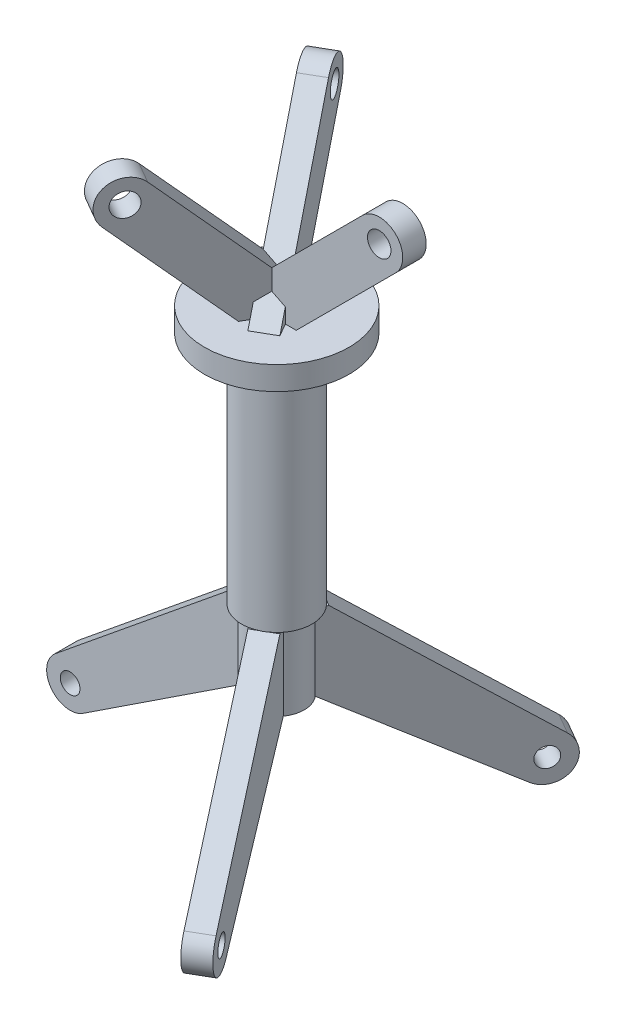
ISO-10303-21;
HEADER;
FILE_DESCRIPTION(('STEP AP214'),'2;1');
FILE_NAME('part.step','',(''),(''),'','','');
FILE_SCHEMA(('AUTOMOTIVE_DESIGN { 1 0 10303 214 1 1 1 1 }'));
ENDSEC;
DATA;
#1=APPLICATION_CONTEXT('core data for automotive mechanical design processes');
#2=APPLICATION_PROTOCOL_DEFINITION('international standard','automotive_design',2000,#1);
#3=PRODUCT_CONTEXT('',#1,'mechanical');
#4=PRODUCT('Part','Part','',(#3));
#5=PRODUCT_RELATED_PRODUCT_CATEGORY('part','',(#4));
#6=PRODUCT_DEFINITION_FORMATION('','',#4);
#7=PRODUCT_DEFINITION_CONTEXT('part definition',#1,'design');
#8=PRODUCT_DEFINITION('design','',#6,#7);
#9=PRODUCT_DEFINITION_SHAPE('','',#8);
#10=(LENGTH_UNIT() NAMED_UNIT(*) SI_UNIT(.MILLI.,.METRE.));
#11=(NAMED_UNIT(*) PLANE_ANGLE_UNIT() SI_UNIT($,.RADIAN.));
#12=(NAMED_UNIT(*) SI_UNIT($,.STERADIAN.) SOLID_ANGLE_UNIT());
#13=UNCERTAINTY_MEASURE_WITH_UNIT(LENGTH_MEASURE(1.E-05),#10,'distance_accuracy_value','');
#14=(GEOMETRIC_REPRESENTATION_CONTEXT(3) GLOBAL_UNCERTAINTY_ASSIGNED_CONTEXT((#13)) GLOBAL_UNIT_ASSIGNED_CONTEXT((#10,
#11,#12)) REPRESENTATION_CONTEXT('',''));
#15=CARTESIAN_POINT('',(0.,0.,0.));
#16=DIRECTION('',(0.,0.,1.));
#17=DIRECTION('',(1.,0.,0.));
#18=AXIS2_PLACEMENT_3D('',#15,#16,#17);
#19=CARTESIAN_POINT('',(0.,165.,0.));
#20=DIRECTION('',(0.,1.,0.));
#21=DIRECTION('',(0.,0.,1.));
#22=AXIS2_PLACEMENT_3D('',#19,#20,#21);
#23=PLANE('',#22);
#24=DIRECTION('',(-0.500000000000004,0.,0.866025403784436));
#25=VECTOR('',#24,1.);
#26=CARTESIAN_POINT('',(-6.49519052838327,165.,-3.75000000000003));
#27=LINE('',#26,#25);
#28=CARTESIAN_POINT('',(-12.9903810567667,165.,7.5));
#29=VERTEX_POINT('',#28);
#30=CARTESIAN_POINT('',(-16.4601733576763,165.,13.5098565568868));
#31=VERTEX_POINT('',#30);
#32=EDGE_CURVE('E438',#29,#31,#27,.T.);
#33=ORIENTED_EDGE('',*,*,#32,.F.);
#34=DIRECTION('',(1.,0.,0.));
#35=VECTOR('',#34,1.);
#36=CARTESIAN_POINT('',(0.,165.,7.5));
#37=LINE('',#36,#35);
#38=CARTESIAN_POINT('',(-22.4964412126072,165.,7.5));
#39=VERTEX_POINT('',#38);
#40=EDGE_CURVE('E694',#39,#29,#37,.T.);
#41=ORIENTED_EDGE('',*,*,#40,.F.);
#42=DIRECTION('',(0.,0.,-1.));
#43=VECTOR('',#42,1.);
#44=CARTESIAN_POINT('',(-22.4964412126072,165.,0.));
#45=LINE('',#44,#43);
#46=CARTESIAN_POINT('',(-22.4964412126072,165.,-7.5));
#47=VERTEX_POINT('',#46);
#48=EDGE_CURVE('E687',#39,#47,#45,.T.);
#49=ORIENTED_EDGE('',*,*,#48,.T.);
#50=DIRECTION('',(1.,0.,0.));
#51=VECTOR('',#50,1.);
#52=CARTESIAN_POINT('',(0.,165.,-7.5));
#53=LINE('',#52,#51);
#54=CARTESIAN_POINT('',(-12.9903810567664,165.,-7.5));
#55=VERTEX_POINT('',#54);
#56=EDGE_CURVE('E691',#47,#55,#53,.T.);
#57=ORIENTED_EDGE('',*,*,#56,.T.);
#58=DIRECTION('',(-0.499999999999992,0.,-0.866025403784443));
#59=VECTOR('',#58,1.);
#60=CARTESIAN_POINT('',(-6.49519052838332,165.,3.74999999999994));
#61=LINE('',#60,#59);
#62=CARTESIAN_POINT('',(-16.4601733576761,165.,-13.509856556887));
#63=VERTEX_POINT('',#62);
#64=EDGE_CURVE('E54',#55,#63,#61,.T.);
#65=ORIENTED_EDGE('',*,*,#64,.T.);
#66=DIRECTION('',(-0.866025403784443,0.,0.499999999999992));
#67=VECTOR('',#66,1.);
#68=CARTESIAN_POINT('',(-3.46979230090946,165.,-21.0098565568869));
#69=LINE('',#68,#67);
#70=CARTESIAN_POINT('',(-3.46979230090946,165.,-21.0098565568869));
#71=VERTEX_POINT('',#70);
#72=EDGE_CURVE('E59',#71,#63,#69,.T.);
#73=ORIENTED_EDGE('',*,*,#72,.F.);
#74=DIRECTION('',(-0.499999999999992,0.,-0.866025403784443));
#75=VECTOR('',#74,1.);
#76=CARTESIAN_POINT('',(6.49519052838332,165.,-3.74999999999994));
#77=LINE('',#76,#75);
#78=CARTESIAN_POINT('',(1.0842021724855E-13,165.,-15.0000000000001));
#79=VERTEX_POINT('',#78);
#80=EDGE_CURVE('E345',#79,#71,#77,.T.);
#81=ORIENTED_EDGE('',*,*,#80,.F.);
#82=DIRECTION('',(-0.500000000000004,0.,0.866025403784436));
#83=VECTOR('',#82,1.);
#84=CARTESIAN_POINT('',(-6.49519052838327,165.,-3.75000000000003));
#85=LINE('',#84,#83);
#86=CARTESIAN_POINT('',(4.75303007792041,165.,-23.232489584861));
#87=VERTEX_POINT('',#86);
#88=EDGE_CURVE('E11',#87,#79,#85,.T.);
#89=ORIENTED_EDGE('',*,*,#88,.F.);
#90=DIRECTION('',(0.866025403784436,0.,0.500000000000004));
#91=VECTOR('',#90,1.);
#92=CARTESIAN_POINT('',(11.2482206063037,165.,-19.482489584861));
#93=LINE('',#92,#91);
#94=CARTESIAN_POINT('',(17.743411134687,165.,-15.7324895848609));
#95=VERTEX_POINT('',#94);
#96=EDGE_CURVE('E443',#87,#95,#93,.T.);
#97=ORIENTED_EDGE('',*,*,#96,.T.);
#98=DIRECTION('',(-0.500000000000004,0.,0.866025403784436));
#99=VECTOR('',#98,1.);
#100=CARTESIAN_POINT('',(6.49519052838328,165.,3.75000000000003));
#101=LINE('',#100,#99);
#102=CARTESIAN_POINT('',(12.9903810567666,165.,-7.5));
#103=VERTEX_POINT('',#102);
#104=EDGE_CURVE('E441',#95,#103,#101,.T.);
#105=ORIENTED_EDGE('',*,*,#104,.T.);
#106=CARTESIAN_POINT('',(19.9299656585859,165.,-7.5));
#107=VERTEX_POINT('',#106);
#108=EDGE_CURVE('E690',#103,#107,#53,.T.);
#109=ORIENTED_EDGE('',*,*,#108,.T.);
#110=DIRECTION('',(0.,0.,-1.));
#111=VECTOR('',#110,1.);
#112=CARTESIAN_POINT('',(19.9299656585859,165.,7.5));
#113=LINE('',#112,#111);
#114=CARTESIAN_POINT('',(19.9299656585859,165.,7.5));
#115=VERTEX_POINT('',#114);
#116=EDGE_CURVE('E477',#115,#107,#113,.T.);
#117=ORIENTED_EDGE('',*,*,#116,.F.);
#118=CARTESIAN_POINT('',(12.9903810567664,165.,7.5));
#119=VERTEX_POINT('',#118);
#120=EDGE_CURVE('E693',#119,#115,#37,.T.);
#121=ORIENTED_EDGE('',*,*,#120,.F.);
#122=DIRECTION('',(-0.499999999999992,0.,-0.866025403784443));
#123=VECTOR('',#122,1.);
#124=CARTESIAN_POINT('',(6.49519052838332,165.,-3.74999999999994));
#125=LINE('',#124,#123);
#126=CARTESIAN_POINT('',(17.7434111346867,165.,15.7324895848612));
#127=VERTEX_POINT('',#126);
#128=EDGE_CURVE('E447',#127,#119,#125,.T.);
#129=ORIENTED_EDGE('',*,*,#128,.F.);
#130=DIRECTION('',(-0.866025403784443,0.,0.499999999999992));
#131=VECTOR('',#130,1.);
#132=CARTESIAN_POINT('',(11.2482206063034,165.,19.4824895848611));
#133=LINE('',#132,#131);
#134=CARTESIAN_POINT('',(4.75303007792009,165.,23.2324895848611));
#135=VERTEX_POINT('',#134);
#136=EDGE_CURVE('E445',#127,#135,#133,.T.);
#137=ORIENTED_EDGE('',*,*,#136,.T.);
#138=DIRECTION('',(-0.499999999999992,0.,-0.866025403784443));
#139=VECTOR('',#138,1.);
#140=CARTESIAN_POINT('',(-6.49519052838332,165.,3.74999999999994));
#141=LINE('',#140,#139);
#142=CARTESIAN_POINT('',(-1.0321604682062E-13,165.,15.0000000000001));
#143=VERTEX_POINT('',#142);
#144=EDGE_CURVE('E47',#135,#143,#141,.T.);
#145=ORIENTED_EDGE('',*,*,#144,.T.);
#146=DIRECTION('',(-0.500000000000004,0.,0.866025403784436));
#147=VECTOR('',#146,1.);
#148=CARTESIAN_POINT('',(6.49519052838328,165.,3.75000000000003));
#149=LINE('',#148,#147);
#150=CARTESIAN_POINT('',(-3.46979230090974,165.,21.0098565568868));
#151=VERTEX_POINT('',#150);
#152=EDGE_CURVE('E433',#143,#151,#149,.T.);
#153=ORIENTED_EDGE('',*,*,#152,.T.);
#154=DIRECTION('',(0.866025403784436,0.,0.500000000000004));
#155=VECTOR('',#154,1.);
#156=CARTESIAN_POINT('',(-16.4601733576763,165.,13.5098565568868));
#157=LINE('',#156,#155);
#158=EDGE_CURVE('E414',#31,#151,#157,.T.);
#159=ORIENTED_EDGE('',*,*,#158,.F.);
#160=EDGE_LOOP('',(#33,#41,#49,#57,#65,#73,#81,#89,#97,#105,#109,#117,#121,#129,#137,#145,#153,#159));
#161=FACE_BOUND('',#160,.T.);
#162=CARTESIAN_POINT('',(0.,165.,0.));
#163=DIRECTION('',(0.,1.,0.));
#164=DIRECTION('',(0.,0.,1.));
#165=AXIS2_PLACEMENT_3D('',#162,#163,#164);
#166=CIRCLE('',#165,46.2);
#167=CARTESIAN_POINT('',(0.,165.,46.2));
#168=VERTEX_POINT('',#167);
#169=EDGE_CURVE('E638',#168,#168,#166,.T.);
#170=ORIENTED_EDGE('',*,*,#169,.T.);
#171=EDGE_LOOP('',(#170));
#172=FACE_BOUND('',#171,.T.);
#173=ADVANCED_FACE('F39',(#161,#172),#23,.T.);
#174=CARTESIAN_POINT('',(72.9594154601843,239.242653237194,7.5));
#175=DIRECTION('',(0.,0.,1.));
#176=DIRECTION('',(1.,0.,0.));
#177=AXIS2_PLACEMENT_3D('',#174,#175,#176);
#178=PLANE('',#177);
#179=CARTESIAN_POINT('',(72.9594154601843,239.242653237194,7.5));
#180=DIRECTION('',(0.,0.,1.));
#181=DIRECTION('',(1.,0.,0.));
#182=AXIS2_PLACEMENT_3D('',#179,#180,#181);
#183=CIRCLE('',#182,7.50000000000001);
#184=CARTESIAN_POINT('',(80.4594154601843,239.242653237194,7.5));
#185=VERTEX_POINT('',#184);
#186=EDGE_CURVE('E451',#185,#185,#183,.T.);
#187=ORIENTED_EDGE('',*,*,#186,.F.);
#188=EDGE_LOOP('',(#187));
#189=FACE_BOUND('',#188,.T.);
#190=DIRECTION('',(-0.707106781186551,-0.707106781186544,0.));
#191=VECTOR('',#190,1.);
#192=CARTESIAN_POINT('',(-22.5,164.996441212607,7.5));
#193=LINE('',#192,#191);
#194=CARTESIAN_POINT('',(62.3528137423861,249.849254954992,7.5));
#195=VERTEX_POINT('',#194);
#196=CARTESIAN_POINT('',(4.33012701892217,191.826568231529,7.5));
#197=VERTEX_POINT('',#196);
#198=EDGE_CURVE('E463',#195,#197,#193,.T.);
#199=ORIENTED_EDGE('',*,*,#198,.T.);
#200=DIRECTION('',(0.,-1.,0.));
#201=VECTOR('',#200,1.);
#202=CARTESIAN_POINT('',(4.33012701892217,239.242653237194,7.5));
#203=LINE('',#202,#201);
#204=CARTESIAN_POINT('',(4.33012701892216,178.836187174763,7.50000000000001));
#205=VERTEX_POINT('',#204);
#206=EDGE_CURVE('E431',#197,#205,#203,.T.);
#207=ORIENTED_EDGE('',*,*,#206,.T.);
#208=DIRECTION('',(0.894427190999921,-0.447213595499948,0.));
#209=VECTOR('',#208,1.);
#210=CARTESIAN_POINT('',(35.0709713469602,163.465765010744,7.5));
#211=LINE('',#210,#209);
#212=CARTESIAN_POINT('',(12.9903810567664,174.506060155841,7.5));
#213=VERTEX_POINT('',#212);
#214=EDGE_CURVE('E714',#205,#213,#211,.T.);
#215=ORIENTED_EDGE('',*,*,#214,.T.);
#216=DIRECTION('',(0.,1.,0.));
#217=VECTOR('',#216,1.);
#218=CARTESIAN_POINT('',(12.9903810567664,239.242653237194,7.5));
#219=LINE('',#218,#217);
#220=EDGE_CURVE('E716',#119,#213,#219,.T.);
#221=ORIENTED_EDGE('',*,*,#220,.F.);
#222=ORIENTED_EDGE('',*,*,#120,.T.);
#223=DIRECTION('',(0.707106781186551,0.707106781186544,0.));
#224=VECTOR('',#223,1.);
#225=CARTESIAN_POINT('',(19.9299656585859,165.,7.5));
#226=LINE('',#225,#224);
#227=CARTESIAN_POINT('',(83.5660171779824,228.636051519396,7.5));
#228=VERTEX_POINT('',#227);
#229=EDGE_CURVE('E457',#115,#228,#226,.T.);
#230=ORIENTED_EDGE('',*,*,#229,.T.);
#231=CARTESIAN_POINT('',(72.9594154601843,239.242653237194,7.5));
#232=DIRECTION('',(0.,0.,1.));
#233=DIRECTION('',(1.,0.,0.));
#234=AXIS2_PLACEMENT_3D('',#231,#232,#233);
#235=CIRCLE('',#234,15.);
#236=EDGE_CURVE('E459',#228,#195,#235,.T.);
#237=ORIENTED_EDGE('',*,*,#236,.T.);
#238=EDGE_LOOP('',(#199,#207,#215,#221,#222,#230,#237));
#239=FACE_BOUND('',#238,.T.);
#240=ADVANCED_FACE('F799',(#189,#239),#178,.T.);
#241=CARTESIAN_POINT('',(72.9594154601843,239.242653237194,-7.5));
#242=DIRECTION('',(0.,0.,1.));
#243=DIRECTION('',(1.,0.,0.));
#244=AXIS2_PLACEMENT_3D('',#241,#242,#243);
#245=PLANE('',#244);
#246=DIRECTION('',(0.,1.,0.));
#247=VECTOR('',#246,1.);
#248=CARTESIAN_POINT('',(-12.9903810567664,239.242653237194,-7.5));
#249=LINE('',#248,#247);
#250=CARTESIAN_POINT('',(-12.9903810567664,174.506060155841,-7.5));
#251=VERTEX_POINT('',#250);
#252=EDGE_CURVE('E427',#55,#251,#249,.T.);
#253=ORIENTED_EDGE('',*,*,#252,.F.);
#254=ORIENTED_EDGE('',*,*,#56,.F.);
#255=DIRECTION('',(-0.707106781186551,-0.707106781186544,0.));
#256=VECTOR('',#255,1.);
#257=CARTESIAN_POINT('',(-22.5,164.996441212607,-7.5));
#258=LINE('',#257,#256);
#259=EDGE_CURVE('E470',#251,#47,#258,.T.);
#260=ORIENTED_EDGE('',*,*,#259,.F.);
#261=EDGE_LOOP('',(#253,#254,#260));
#262=FACE_BOUND('',#261,.T.);
#263=ADVANCED_FACE('F820',(#262),#245,.F.);
#264=CARTESIAN_POINT('',(-22.5,164.996441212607,7.5));
#265=DIRECTION('',(0.707106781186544,-0.707106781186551,0.));
#266=DIRECTION('',(0.707106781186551,0.707106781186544,0.));
#267=AXIS2_PLACEMENT_3D('',#264,#265,#266);
#268=PLANE('',#267);
#269=DIRECTION('',(-0.447213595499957,-0.447213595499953,-0.774596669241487));
#270=VECTOR('',#269,1.);
#271=CARTESIAN_POINT('',(-6.40192378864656,181.09451742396,-11.0884572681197));
#272=LINE('',#271,#270);
#273=CARTESIAN_POINT('',(0.,187.496441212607,0.));
#274=VERTEX_POINT('',#273);
#275=EDGE_CURVE('E700',#197,#274,#272,.T.);
#276=ORIENTED_EDGE('',*,*,#275,.F.);
#277=ORIENTED_EDGE('',*,*,#198,.F.);
#278=DIRECTION('',(0.,0.,-1.));
#279=VECTOR('',#278,1.);
#280=CARTESIAN_POINT('',(62.3528137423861,249.849254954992,7.5));
#281=LINE('',#280,#279);
#282=CARTESIAN_POINT('',(62.3528137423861,249.849254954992,-7.5));
#283=VERTEX_POINT('',#282);
#284=EDGE_CURVE('E466',#195,#283,#281,.T.);
#285=ORIENTED_EDGE('',*,*,#284,.T.);
#286=CARTESIAN_POINT('',(4.33012701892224,191.826568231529,-7.5));
#287=VERTEX_POINT('',#286);
#288=EDGE_CURVE('E460',#283,#287,#258,.T.);
#289=ORIENTED_EDGE('',*,*,#288,.T.);
#290=DIRECTION('',(0.447213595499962,0.447213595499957,-0.774596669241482));
#291=VECTOR('',#290,1.);
#292=CARTESIAN_POINT('',(-11.5980762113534,175.898365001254,20.0884572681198));
#293=LINE('',#292,#291);
#294=EDGE_CURVE('E697',#274,#287,#293,.T.);
#295=ORIENTED_EDGE('',*,*,#294,.F.);
#296=EDGE_LOOP('',(#276,#277,#285,#289,#295));
#297=FACE_BOUND('',#296,.T.);
#298=ADVANCED_FACE('F1010',(#297),#268,.F.);
#299=CARTESIAN_POINT('',(0.,150.,0.));
#300=DIRECTION('',(0.,-1.,0.));
#301=DIRECTION('',(0.,0.,-1.));
#302=AXIS2_PLACEMENT_3D('',#299,#300,#301);
#303=CYLINDRICAL_SURFACE('',#302,22.5);
#304=CARTESIAN_POINT('',(0.,150.,0.));
#305=DIRECTION('',(0.,1.,0.));
#306=DIRECTION('',(0.,0.,1.));
#307=AXIS2_PLACEMENT_3D('',#304,#305,#306);
#308=CIRCLE('',#307,22.5);
#309=CARTESIAN_POINT('',(0.,150.,22.5));
#310=VERTEX_POINT('',#309);
#311=EDGE_CURVE('E654',#310,#310,#308,.T.);
#312=ORIENTED_EDGE('',*,*,#311,.F.);
#313=EDGE_LOOP('',(#312));
#314=FACE_BOUND('',#313,.T.);
#315=CARTESIAN_POINT('',(0.,0.062879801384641,0.));
#316=DIRECTION('',(0.,-1.,0.));
#317=DIRECTION('',(0.,0.,-1.));
#318=AXIS2_PLACEMENT_3D('',#315,#316,#317);
#319=CIRCLE('',#318,22.5);
#320=CARTESIAN_POINT('',(4.11141118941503,0.0628798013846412,-22.1211730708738));
#321=VERTEX_POINT('',#320);
#322=CARTESIAN_POINT('',(9.5990467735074,0.0628798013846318,-20.3496511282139));
#323=VERTEX_POINT('',#322);
#324=EDGE_CURVE('E686',#321,#323,#319,.T.);
#325=ORIENTED_EDGE('',*,*,#324,.F.);
#326=DIRECTION('',(0.,-1.,0.));
#327=VECTOR('',#326,1.);
#328=CARTESIAN_POINT('',(4.11141118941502,150.,-22.1211730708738));
#329=LINE('',#328,#327);
#330=CARTESIAN_POINT('',(4.11141118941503,0.,-22.1211730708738));
#331=VERTEX_POINT('',#330);
#332=EDGE_CURVE('E578',#321,#331,#329,.T.);
#333=ORIENTED_EDGE('',*,*,#332,.T.);
#334=CARTESIAN_POINT('',(0.,0.,0.));
#335=DIRECTION('',(0.,1.,0.));
#336=DIRECTION('',(0.,0.,1.));
#337=AXIS2_PLACEMENT_3D('',#334,#335,#336);
#338=CIRCLE('',#337,22.5);
#339=CARTESIAN_POINT('',(-21.2132034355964,0.,-7.5));
#340=VERTEX_POINT('',#339);
#341=EDGE_CURVE('E646',#331,#340,#338,.T.);
#342=ORIENTED_EDGE('',*,*,#341,.T.);
#343=DIRECTION('',(0.,-1.,0.));
#344=VECTOR('',#343,1.);
#345=CARTESIAN_POINT('',(-21.2132034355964,150.,-7.5));
#346=LINE('',#345,#344);
#347=CARTESIAN_POINT('',(-21.2132034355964,0.0628798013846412,-7.5));
#348=VERTEX_POINT('',#347);
#349=EDGE_CURVE('E627',#348,#340,#346,.T.);
#350=ORIENTED_EDGE('',*,*,#349,.F.);
#351=CARTESIAN_POINT('',(0.,0.062879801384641,0.));
#352=DIRECTION('',(0.,-1.,0.));
#353=DIRECTION('',(1.,0.,0.));
#354=AXIS2_PLACEMENT_3D('',#351,#352,#353);
#355=CIRCLE('',#354,22.5);
#356=CARTESIAN_POINT('',(-22.4228382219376,0.0628798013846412,-1.86180720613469));
#357=VERTEX_POINT('',#356);
#358=EDGE_CURVE('E665',#357,#348,#355,.T.);
#359=ORIENTED_EDGE('',*,*,#358,.F.);
#360=CARTESIAN_POINT('',(0.,18.3354449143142,0.));
#361=DIRECTION('',(0.631716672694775,-0.775199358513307,0.));
#362=DIRECTION('',(-0.775199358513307,-0.631716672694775,0.));
#363=AXIS2_PLACEMENT_3D('',#360,#361,#362);
#364=ELLIPSE('',#363,29.0247918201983,22.5);
#365=CARTESIAN_POINT('',(-22.4228382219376,0.0628798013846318,1.86180720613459));
#366=VERTEX_POINT('',#365);
#367=EDGE_CURVE('E635',#366,#357,#364,.T.);
#368=ORIENTED_EDGE('',*,*,#367,.F.);
#369=CARTESIAN_POINT('',(-21.2132034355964,0.0628798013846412,7.5));
#370=VERTEX_POINT('',#369);
#371=EDGE_CURVE('E668',#370,#366,#355,.T.);
#372=ORIENTED_EDGE('',*,*,#371,.F.);
#373=DIRECTION('',(0.,-1.,0.));
#374=VECTOR('',#373,1.);
#375=CARTESIAN_POINT('',(-21.2132034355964,150.,7.5));
#376=LINE('',#375,#374);
#377=CARTESIAN_POINT('',(-21.2132034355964,0.,7.5));
#378=VERTEX_POINT('',#377);
#379=EDGE_CURVE('E633',#370,#378,#376,.T.);
#380=ORIENTED_EDGE('',*,*,#379,.T.);
#381=CARTESIAN_POINT('',(4.11141118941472,0.,22.1211730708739));
#382=VERTEX_POINT('',#381);
#383=EDGE_CURVE('E657',#378,#382,#338,.T.);
#384=ORIENTED_EDGE('',*,*,#383,.T.);
#385=DIRECTION('',(0.,-1.,0.));
#386=VECTOR('',#385,1.);
#387=CARTESIAN_POINT('',(4.11141118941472,150.,22.1211730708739));
#388=LINE('',#387,#386);
#389=CARTESIAN_POINT('',(4.11141118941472,0.0628798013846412,22.1211730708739));
#390=VERTEX_POINT('',#389);
#391=EDGE_CURVE('E563',#390,#382,#388,.T.);
#392=ORIENTED_EDGE('',*,*,#391,.F.);
#393=CARTESIAN_POINT('',(0.,0.062879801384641,0.));
#394=DIRECTION('',(0.,-1.,0.));
#395=DIRECTION('',(0.,0.,-1.));
#396=AXIS2_PLACEMENT_3D('',#393,#394,#395);
#397=CIRCLE('',#396,22.5);
#398=CARTESIAN_POINT('',(9.59904677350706,0.0628798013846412,20.3496511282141));
#399=VERTEX_POINT('',#398);
#400=EDGE_CURVE('E679',#399,#390,#397,.T.);
#401=ORIENTED_EDGE('',*,*,#400,.F.);
#402=CARTESIAN_POINT('',(0.,18.3354449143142,0.));
#403=DIRECTION('',(-0.315858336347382,-0.775199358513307,-0.547082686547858));
#404=DIRECTION('',(0.387599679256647,-0.631716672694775,0.671342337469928));
#405=AXIS2_PLACEMENT_3D('',#402,#403,#404);
#406=ELLIPSE('',#405,29.0247918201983,22.5);
#407=CARTESIAN_POINT('',(12.8237914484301,0.0628798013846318,18.4878439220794));
#408=VERTEX_POINT('',#407);
#409=EDGE_CURVE('E580',#408,#399,#406,.T.);
#410=ORIENTED_EDGE('',*,*,#409,.F.);
#411=CARTESIAN_POINT('',(17.1017922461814,0.0628798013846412,14.621173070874));
#412=VERTEX_POINT('',#411);
#413=EDGE_CURVE('E682',#412,#408,#397,.T.);
#414=ORIENTED_EDGE('',*,*,#413,.F.);
#415=DIRECTION('',(0.,-1.,0.));
#416=VECTOR('',#415,1.);
#417=CARTESIAN_POINT('',(17.1017922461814,150.,14.621173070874));
#418=LINE('',#417,#416);
#419=CARTESIAN_POINT('',(17.1017922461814,0.,14.621173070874));
#420=VERTEX_POINT('',#419);
#421=EDGE_CURVE('E568',#412,#420,#418,.T.);
#422=ORIENTED_EDGE('',*,*,#421,.T.);
#423=CARTESIAN_POINT('',(17.1017922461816,0.,-14.6211730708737));
#424=VERTEX_POINT('',#423);
#425=EDGE_CURVE('E660',#420,#424,#338,.T.);
#426=ORIENTED_EDGE('',*,*,#425,.T.);
#427=DIRECTION('',(0.,-1.,0.));
#428=VECTOR('',#427,1.);
#429=CARTESIAN_POINT('',(17.1017922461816,150.,-14.6211730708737));
#430=LINE('',#429,#428);
#431=CARTESIAN_POINT('',(17.1017922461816,0.0628798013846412,-14.6211730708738));
#432=VERTEX_POINT('',#431);
#433=EDGE_CURVE('E573',#432,#424,#430,.T.);
#434=ORIENTED_EDGE('',*,*,#433,.F.);
#435=CARTESIAN_POINT('',(12.8237914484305,0.0628798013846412,-18.4878439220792));
#436=VERTEX_POINT('',#435);
#437=EDGE_CURVE('E683',#436,#432,#319,.T.);
#438=ORIENTED_EDGE('',*,*,#437,.F.);
#439=CARTESIAN_POINT('',(0.,18.3354449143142,0.));
#440=DIRECTION('',(-0.31585833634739,-0.775199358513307,0.547082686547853));
#441=DIRECTION('',(0.387599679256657,-0.631716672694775,-0.671342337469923));
#442=AXIS2_PLACEMENT_3D('',#439,#440,#441);
#443=ELLIPSE('',#442,29.0247918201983,22.5);
#444=EDGE_CURVE('E582',#323,#436,#443,.T.);
#445=ORIENTED_EDGE('',*,*,#444,.F.);
#446=EDGE_LOOP('',(#325,#333,#342,#350,#359,#368,#372,#380,#384,#392,#401,#410,#414,#422,#426,
#434,#438,#445));
#447=FACE_BOUND('',#446,.T.);
#448=ADVANCED_FACE('F41',(#314,#447),#303,.T.);
#449=CARTESIAN_POINT('',(0.,0.,0.));
#450=DIRECTION('',(0.,1.,0.));
#451=DIRECTION('',(0.,0.,1.));
#452=AXIS2_PLACEMENT_3D('',#449,#450,#451);
#453=PLANE('',#452);
#454=DIRECTION('',(-0.500000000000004,0.,0.866025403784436));
#455=VECTOR('',#454,1.);
#456=CARTESIAN_POINT('',(6.49519052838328,0.,3.75000000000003));
#457=LINE('',#456,#455);
#458=CARTESIAN_POINT('',(14.4008846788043,0.,-9.94306393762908));
#459=VERTEX_POINT('',#458);
#460=EDGE_CURVE('E570',#424,#459,#457,.T.);
#461=ORIENTED_EDGE('',*,*,#460,.F.);
#462=ORIENTED_EDGE('',*,*,#425,.F.);
#463=DIRECTION('',(-0.499999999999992,0.,-0.866025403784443));
#464=VECTOR('',#463,1.);
#465=CARTESIAN_POINT('',(6.49519052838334,0.,-3.74999999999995));
#466=LINE('',#465,#464);
#467=CARTESIAN_POINT('',(14.4008846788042,0.,9.94306393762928));
#468=VERTEX_POINT('',#467);
#469=EDGE_CURVE('E566',#420,#468,#466,.T.);
#470=ORIENTED_EDGE('',*,*,#469,.T.);
#471=CARTESIAN_POINT('',(0.,0.,0.));
#472=DIRECTION('',(0.,-1.,0.));
#473=DIRECTION('',(0.,0.,-1.));
#474=AXIS2_PLACEMENT_3D('',#471,#472,#473);
#475=CIRCLE('',#474,17.5);
#476=EDGE_CURVE('E652',#459,#468,#475,.T.);
#477=ORIENTED_EDGE('',*,*,#476,.F.);
#478=EDGE_LOOP('',(#461,#462,#470,#477));
#479=FACE_BOUND('',#478,.T.);
#480=ADVANCED_FACE('F848',(#479),#453,.F.);
#481=DIRECTION('',(-0.499999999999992,0.,-0.866025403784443));
#482=VECTOR('',#481,1.);
#483=CARTESIAN_POINT('',(-6.49519052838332,0.,3.74999999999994));
#484=LINE('',#483,#482);
#485=CARTESIAN_POINT('',(1.4105036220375,0.,17.4430639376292));
#486=VERTEX_POINT('',#485);
#487=EDGE_CURVE('E560',#382,#486,#484,.T.);
#488=ORIENTED_EDGE('',*,*,#487,.F.);
#489=ORIENTED_EDGE('',*,*,#383,.F.);
#490=DIRECTION('',(1.,0.,0.));
#491=VECTOR('',#490,1.);
#492=CARTESIAN_POINT('',(0.,0.,7.5));
#493=LINE('',#492,#491);
#494=CARTESIAN_POINT('',(-15.8113883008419,0.,7.5));
#495=VERTEX_POINT('',#494);
#496=EDGE_CURVE('E630',#378,#495,#493,.T.);
#497=ORIENTED_EDGE('',*,*,#496,.T.);
#498=EDGE_CURVE('E653',#486,#495,#475,.T.);
#499=ORIENTED_EDGE('',*,*,#498,.F.);
#500=EDGE_LOOP('',(#488,#489,#497,#499));
#501=FACE_BOUND('',#500,.T.);
#502=ADVANCED_FACE('F849',(#501),#453,.F.);
#503=CARTESIAN_POINT('',(0.,-50.,0.));
#504=DIRECTION('',(0.,1.,0.));
#505=DIRECTION('',(0.,0.,1.));
#506=AXIS2_PLACEMENT_3D('',#503,#504,#505);
#507=CYLINDRICAL_SURFACE('',#506,17.5);
#508=DIRECTION('',(0.,1.,0.));
#509=VECTOR('',#508,1.);
#510=CARTESIAN_POINT('',(14.4008846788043,-50.,-9.94306393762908));
#511=LINE('',#510,#509);
#512=CARTESIAN_POINT('',(14.4008846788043,-48.8885426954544,-9.94306393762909));
#513=VERTEX_POINT('',#512);
#514=EDGE_CURVE('E674',#459,#513,#511,.F.);
#515=ORIENTED_EDGE('',*,*,#514,.F.);
#516=ORIENTED_EDGE('',*,*,#476,.T.);
#517=DIRECTION('',(0.,1.,0.));
#518=VECTOR('',#517,1.);
#519=CARTESIAN_POINT('',(14.4008846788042,-50.,9.94306393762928));
#520=LINE('',#519,#518);
#521=CARTESIAN_POINT('',(14.4008846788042,-48.8885426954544,9.9430639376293));
#522=VERTEX_POINT('',#521);
#523=EDGE_CURVE('E672',#468,#522,#520,.F.);
#524=ORIENTED_EDGE('',*,*,#523,.T.);
#525=CARTESIAN_POINT('',(0.,-38.4813644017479,0.));
#526=DIRECTION('',(0.274899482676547,0.835297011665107,0.47613987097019));
#527=DIRECTION('',(-0.417648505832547,0.549798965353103,-0.723388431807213));
#528=AXIS2_PLACEMENT_3D('',#525,#526,#527);
#529=ELLIPSE('',#528,20.9506316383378,17.5);
#530=CARTESIAN_POINT('',(8.74999999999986,-50.,15.1554445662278));
#531=VERTEX_POINT('',#530);
#532=EDGE_CURVE('E518',#531,#522,#529,.T.);
#533=ORIENTED_EDGE('',*,*,#532,.F.);
#534=CARTESIAN_POINT('',(0.,-50.,0.));
#535=DIRECTION('',(0.,-1.,0.));
#536=DIRECTION('',(0.,0.,-1.));
#537=AXIS2_PLACEMENT_3D('',#534,#535,#536);
#538=CIRCLE('',#537,17.5);
#539=CARTESIAN_POINT('',(8.75000000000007,-50.,-15.1554445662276));
#540=VERTEX_POINT('',#539);
#541=EDGE_CURVE('E647',#540,#531,#538,.T.);
#542=ORIENTED_EDGE('',*,*,#541,.F.);
#543=CARTESIAN_POINT('',(0.,-38.4813644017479,0.));
#544=DIRECTION('',(0.274899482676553,0.835297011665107,-0.476139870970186));
#545=DIRECTION('',(-0.417648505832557,0.549798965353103,0.723388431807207));
#546=AXIS2_PLACEMENT_3D('',#543,#544,#545);
#547=ELLIPSE('',#546,20.9506316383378,17.5);
#548=EDGE_CURVE('E556',#513,#540,#547,.T.);
#549=ORIENTED_EDGE('',*,*,#548,.F.);
#550=EDGE_LOOP('',(#515,#516,#524,#533,#542,#549));
#551=FACE_BOUND('',#550,.T.);
#552=ADVANCED_FACE('F844',(#551),#507,.T.);
#553=DIRECTION('',(0.,1.,0.));
#554=VECTOR('',#553,1.);
#555=CARTESIAN_POINT('',(1.4105036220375,-50.,17.4430639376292));
#556=LINE('',#555,#554);
#557=CARTESIAN_POINT('',(1.41050362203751,-48.8885426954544,17.4430639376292));
#558=VERTEX_POINT('',#557);
#559=EDGE_CURVE('E669',#486,#558,#556,.F.);
#560=ORIENTED_EDGE('',*,*,#559,.F.);
#561=ORIENTED_EDGE('',*,*,#498,.T.);
#562=DIRECTION('',(0.,1.,0.));
#563=VECTOR('',#562,1.);
#564=CARTESIAN_POINT('',(-15.8113883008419,-50.,7.5));
#565=LINE('',#564,#563);
#566=CARTESIAN_POINT('',(-15.8113883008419,-48.8885426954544,7.5));
#567=VERTEX_POINT('',#566);
#568=EDGE_CURVE('E663',#495,#567,#565,.F.);
#569=ORIENTED_EDGE('',*,*,#568,.T.);
#570=CARTESIAN_POINT('',(0.,-38.4813644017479,0.));
#571=DIRECTION('',(-0.549798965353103,0.835297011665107,0.));
#572=DIRECTION('',(0.835297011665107,0.549798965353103,0.));
#573=AXIS2_PLACEMENT_3D('',#570,#571,#572);
#574=ELLIPSE('',#573,20.9506316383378,17.5);
#575=CARTESIAN_POINT('',(-17.5,-50.,0.));
#576=VERTEX_POINT('',#575);
#577=EDGE_CURVE('E620',#576,#567,#574,.T.);
#578=ORIENTED_EDGE('',*,*,#577,.F.);
#579=EDGE_CURVE('E641',#531,#576,#538,.T.);
#580=ORIENTED_EDGE('',*,*,#579,.F.);
#581=EDGE_CURVE('E555',#558,#531,#529,.T.);
#582=ORIENTED_EDGE('',*,*,#581,.F.);
#583=EDGE_LOOP('',(#560,#561,#569,#578,#580,#582));
#584=FACE_BOUND('',#583,.T.);
#585=ADVANCED_FACE('F845',(#584),#507,.T.);
#586=ORIENTED_EDGE('',*,*,#341,.F.);
#587=DIRECTION('',(-0.500000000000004,0.,0.866025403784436));
#588=VECTOR('',#587,1.);
#589=CARTESIAN_POINT('',(-6.49519052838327,0.,-3.75000000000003));
#590=LINE('',#589,#588);
#591=CARTESIAN_POINT('',(1.41050362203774,0.,-17.4430639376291));
#592=VERTEX_POINT('',#591);
#593=EDGE_CURVE('E576',#331,#592,#590,.T.);
#594=ORIENTED_EDGE('',*,*,#593,.T.);
#595=CARTESIAN_POINT('',(-15.8113883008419,0.,-7.5));
#596=VERTEX_POINT('',#595);
#597=EDGE_CURVE('E648',#596,#592,#475,.T.);
#598=ORIENTED_EDGE('',*,*,#597,.F.);
#599=DIRECTION('',(1.,0.,0.));
#600=VECTOR('',#599,1.);
#601=CARTESIAN_POINT('',(0.,0.,-7.5));
#602=LINE('',#601,#600);
#603=EDGE_CURVE('E624',#340,#596,#602,.T.);
#604=ORIENTED_EDGE('',*,*,#603,.F.);
#605=EDGE_LOOP('',(#586,#594,#598,#604));
#606=FACE_BOUND('',#605,.T.);
#607=ADVANCED_FACE('F842',(#606),#453,.F.);
#608=ORIENTED_EDGE('',*,*,#597,.T.);
#609=DIRECTION('',(0.,1.,0.));
#610=VECTOR('',#609,1.);
#611=CARTESIAN_POINT('',(1.41050362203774,-50.,-17.4430639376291));
#612=LINE('',#611,#610);
#613=CARTESIAN_POINT('',(1.41050362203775,-48.8885426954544,-17.4430639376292));
#614=VERTEX_POINT('',#613);
#615=EDGE_CURVE('E677',#592,#614,#612,.F.);
#616=ORIENTED_EDGE('',*,*,#615,.T.);
#617=EDGE_CURVE('E559',#540,#614,#547,.T.);
#618=ORIENTED_EDGE('',*,*,#617,.F.);
#619=EDGE_CURVE('E644',#576,#540,#538,.T.);
#620=ORIENTED_EDGE('',*,*,#619,.F.);
#621=CARTESIAN_POINT('',(-15.8113883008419,-48.8885426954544,-7.5));
#622=VERTEX_POINT('',#621);
#623=EDGE_CURVE('E623',#622,#576,#574,.T.);
#624=ORIENTED_EDGE('',*,*,#623,.F.);
#625=DIRECTION('',(0.,1.,0.));
#626=VECTOR('',#625,1.);
#627=CARTESIAN_POINT('',(-15.8113883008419,-50.,-7.5));
#628=LINE('',#627,#626);
#629=EDGE_CURVE('E651',#596,#622,#628,.F.);
#630=ORIENTED_EDGE('',*,*,#629,.F.);
#631=EDGE_LOOP('',(#608,#616,#618,#620,#624,#630));
#632=FACE_BOUND('',#631,.T.);
#633=ADVANCED_FACE('F839',(#632),#507,.T.);
#634=CARTESIAN_POINT('',(0.,-50.,0.));
#635=DIRECTION('',(0.,-1.,0.));
#636=DIRECTION('',(0.,0.,-1.));
#637=AXIS2_PLACEMENT_3D('',#634,#635,#636);
#638=PLANE('',#637);
#639=ORIENTED_EDGE('',*,*,#619,.T.);
#640=ORIENTED_EDGE('',*,*,#541,.T.);
#641=ORIENTED_EDGE('',*,*,#579,.T.);
#642=EDGE_LOOP('',(#639,#640,#641));
#643=FACE_BOUND('',#642,.T.);
#644=ADVANCED_FACE('F835',(#643),#638,.T.);
#645=CARTESIAN_POINT('',(0.,165.,0.));
#646=DIRECTION('',(0.,-1.,0.));
#647=DIRECTION('',(0.,0.,-1.));
#648=AXIS2_PLACEMENT_3D('',#645,#646,#647);
#649=CYLINDRICAL_SURFACE('',#648,46.2);
#650=ORIENTED_EDGE('',*,*,#169,.F.);
#651=EDGE_LOOP('',(#650));
#652=FACE_BOUND('',#651,.T.);
#653=CARTESIAN_POINT('',(0.,150.,0.));
#654=DIRECTION('',(0.,1.,0.));
#655=DIRECTION('',(0.,0.,1.));
#656=AXIS2_PLACEMENT_3D('',#653,#654,#655);
#657=CIRCLE('',#656,46.2);
#658=CARTESIAN_POINT('',(0.,150.,46.2));
#659=VERTEX_POINT('',#658);
#660=EDGE_CURVE('E637',#659,#659,#657,.T.);
#661=ORIENTED_EDGE('',*,*,#660,.T.);
#662=EDGE_LOOP('',(#661));
#663=FACE_BOUND('',#662,.T.);
#664=ADVANCED_FACE('F831',(#652,#663),#649,.T.);
#665=CARTESIAN_POINT('',(0.,150.,0.));
#666=DIRECTION('',(0.,1.,0.));
#667=DIRECTION('',(0.,0.,1.));
#668=AXIS2_PLACEMENT_3D('',#665,#666,#667);
#669=PLANE('',#668);
#670=ORIENTED_EDGE('',*,*,#311,.T.);
#671=EDGE_LOOP('',(#670));
#672=FACE_BOUND('',#671,.T.);
#673=ORIENTED_EDGE('',*,*,#660,.F.);
#674=EDGE_LOOP('',(#673));
#675=FACE_BOUND('',#674,.T.);
#676=ADVANCED_FACE('F827',(#672,#675),#669,.F.);
#677=CARTESIAN_POINT('',(-22.4228382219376,0.0628798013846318,7.5));
#678=DIRECTION('',(0.,-1.,0.));
#679=DIRECTION('',(1.,0.,0.));
#680=AXIS2_PLACEMENT_3D('',#677,#678,#679);
#681=PLANE('',#680);
#682=DIRECTION('',(-1.,0.,0.));
#683=VECTOR('',#682,1.);
#684=CARTESIAN_POINT('',(-22.4228382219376,0.0628798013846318,7.5));
#685=LINE('',#684,#683);
#686=CARTESIAN_POINT('',(-22.4228382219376,0.0628798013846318,7.5));
#687=VERTEX_POINT('',#686);
#688=EDGE_CURVE('E599',#370,#687,#685,.T.);
#689=ORIENTED_EDGE('',*,*,#688,.F.);
#690=ORIENTED_EDGE('',*,*,#371,.T.);
#691=DIRECTION('',(0.,0.,-1.));
#692=VECTOR('',#691,1.);
#693=CARTESIAN_POINT('',(-22.4228382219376,0.0628798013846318,7.5));
#694=LINE('',#693,#692);
#695=EDGE_CURVE('E611',#687,#366,#694,.T.);
#696=ORIENTED_EDGE('',*,*,#695,.F.);
#697=EDGE_LOOP('',(#689,#690,#696));
#698=FACE_BOUND('',#697,.T.);
#699=ADVANCED_FACE('F830',(#698),#681,.F.);
#700=CARTESIAN_POINT('',(-22.5,0.,7.5));
#701=DIRECTION('',(0.631716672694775,-0.775199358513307,0.));
#702=DIRECTION('',(0.775199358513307,0.631716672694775,0.));
#703=AXIS2_PLACEMENT_3D('',#700,#701,#702);
#704=PLANE('',#703);
#705=ORIENTED_EDGE('',*,*,#695,.T.);
#706=ORIENTED_EDGE('',*,*,#367,.T.);
#707=CARTESIAN_POINT('',(-22.4228382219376,0.0628798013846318,-7.5));
#708=VERTEX_POINT('',#707);
#709=EDGE_CURVE('E601',#357,#708,#694,.T.);
#710=ORIENTED_EDGE('',*,*,#709,.T.);
#711=DIRECTION('',(-0.775199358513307,-0.631716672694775,0.));
#712=VECTOR('',#711,1.);
#713=CARTESIAN_POINT('',(-22.5,0.,-7.5));
#714=LINE('',#713,#712);
#715=CARTESIAN_POINT('',(-133.975750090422,-90.8425544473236,-7.5));
#716=VERTEX_POINT('',#715);
#717=EDGE_CURVE('E588',#708,#716,#714,.T.);
#718=ORIENTED_EDGE('',*,*,#717,.T.);
#719=DIRECTION('',(0.,0.,-1.));
#720=VECTOR('',#719,1.);
#721=CARTESIAN_POINT('',(-133.975750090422,-90.8425544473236,7.5));
#722=LINE('',#721,#720);
#723=CARTESIAN_POINT('',(-133.975750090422,-90.8425544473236,7.5));
#724=VERTEX_POINT('',#723);
#725=EDGE_CURVE('E617',#724,#716,#722,.T.);
#726=ORIENTED_EDGE('',*,*,#725,.F.);
#727=DIRECTION('',(-0.775199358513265,-0.631716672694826,0.));
#728=VECTOR('',#727,1.);
#729=CARTESIAN_POINT('',(-22.5,0.,7.5));
#730=LINE('',#729,#728);
#731=EDGE_CURVE('E591',#687,#724,#730,.T.);
#732=ORIENTED_EDGE('',*,*,#731,.F.);
#733=EDGE_LOOP('',(#705,#706,#710,#718,#726,#732));
#734=FACE_BOUND('',#733,.T.);
#735=ADVANCED_FACE('F825',(#734),#704,.F.);
#736=CARTESIAN_POINT('',(-124.5,-102.470544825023,7.5));
#737=DIRECTION('',(0.,0.,1.));
#738=DIRECTION('',(1.,0.,0.));
#739=AXIS2_PLACEMENT_3D('',#736,#737,#738);
#740=PLANE('',#739);
#741=CARTESIAN_POINT('',(-124.5,-102.470544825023,7.5));
#742=DIRECTION('',(0.,0.,1.));
#743=DIRECTION('',(1.,0.,0.));
#744=AXIS2_PLACEMENT_3D('',#741,#742,#743);
#745=CIRCLE('',#744,6.3);
#746=CARTESIAN_POINT('',(-118.2,-102.470544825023,7.5));
#747=VERTEX_POINT('',#746);
#748=EDGE_CURVE('E585',#747,#747,#745,.T.);
#749=ORIENTED_EDGE('',*,*,#748,.F.);
#750=EDGE_LOOP('',(#749));
#751=FACE_BOUND('',#750,.T.);
#752=ORIENTED_EDGE('',*,*,#379,.F.);
#753=ORIENTED_EDGE('',*,*,#688,.T.);
#754=ORIENTED_EDGE('',*,*,#731,.T.);
#755=CARTESIAN_POINT('',(-124.5,-102.470544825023,7.5));
#756=DIRECTION('',(0.,0.,1.));
#757=DIRECTION('',(1.,0.,0.));
#758=AXIS2_PLACEMENT_3D('',#755,#756,#757);
#759=CIRCLE('',#758,15.);
#760=CARTESIAN_POINT('',(-116.253015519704,-115.,7.5));
#761=VERTEX_POINT('',#760);
#762=EDGE_CURVE('E593',#724,#761,#759,.T.);
#763=ORIENTED_EDGE('',*,*,#762,.T.);
#764=DIRECTION('',(0.835297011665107,0.549798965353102,0.));
#765=VECTOR('',#764,1.);
#766=CARTESIAN_POINT('',(-17.5,-50.,7.5));
#767=LINE('',#766,#765);
#768=EDGE_CURVE('E596',#761,#567,#767,.T.);
#769=ORIENTED_EDGE('',*,*,#768,.T.);
#770=ORIENTED_EDGE('',*,*,#568,.F.);
#771=ORIENTED_EDGE('',*,*,#496,.F.);
#772=EDGE_LOOP('',(#752,#753,#754,#763,#769,#770,#771));
#773=FACE_BOUND('',#772,.T.);
#774=ADVANCED_FACE('F919',(#751,#773),#740,.T.);
#775=CARTESIAN_POINT('',(-124.5,-102.470544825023,-7.5));
#776=DIRECTION('',(0.,0.,1.));
#777=DIRECTION('',(1.,0.,0.));
#778=AXIS2_PLACEMENT_3D('',#775,#776,#777);
#779=PLANE('',#778);
#780=CARTESIAN_POINT('',(-124.5,-102.470544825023,-7.5));
#781=DIRECTION('',(0.,0.,1.));
#782=DIRECTION('',(1.,0.,0.));
#783=AXIS2_PLACEMENT_3D('',#780,#781,#782);
#784=CIRCLE('',#783,6.3);
#785=CARTESIAN_POINT('',(-118.2,-102.470544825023,-7.5));
#786=VERTEX_POINT('',#785);
#787=EDGE_CURVE('E584',#786,#786,#784,.T.);
#788=ORIENTED_EDGE('',*,*,#787,.T.);
#789=EDGE_LOOP('',(#788));
#790=FACE_BOUND('',#789,.T.);
#791=DIRECTION('',(-1.,0.,0.));
#792=VECTOR('',#791,1.);
#793=CARTESIAN_POINT('',(-22.4228382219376,0.0628798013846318,-7.5));
#794=LINE('',#793,#792);
#795=EDGE_CURVE('E594',#348,#708,#794,.T.);
#796=ORIENTED_EDGE('',*,*,#795,.F.);
#797=ORIENTED_EDGE('',*,*,#349,.T.);
#798=ORIENTED_EDGE('',*,*,#603,.T.);
#799=ORIENTED_EDGE('',*,*,#629,.T.);
#800=DIRECTION('',(0.835297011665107,0.549798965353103,0.));
#801=VECTOR('',#800,1.);
#802=CARTESIAN_POINT('',(-17.5,-50.,-7.5));
#803=LINE('',#802,#801);
#804=CARTESIAN_POINT('',(-116.253015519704,-115.,-7.5));
#805=VERTEX_POINT('',#804);
#806=EDGE_CURVE('E606',#805,#622,#803,.T.);
#807=ORIENTED_EDGE('',*,*,#806,.F.);
#808=CARTESIAN_POINT('',(-124.5,-102.470544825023,-7.5));
#809=DIRECTION('',(0.,0.,1.));
#810=DIRECTION('',(1.,0.,0.));
#811=AXIS2_PLACEMENT_3D('',#808,#809,#810);
#812=CIRCLE('',#811,15.);
#813=EDGE_CURVE('E603',#716,#805,#812,.T.);
#814=ORIENTED_EDGE('',*,*,#813,.F.);
#815=ORIENTED_EDGE('',*,*,#717,.F.);
#816=EDGE_LOOP('',(#796,#797,#798,#799,#807,#814,#815));
#817=FACE_BOUND('',#816,.T.);
#818=ADVANCED_FACE('F904',(#790,#817),#779,.F.);
#819=CARTESIAN_POINT('',(-17.5,-50.,7.5));
#820=DIRECTION('',(-0.549798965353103,0.835297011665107,0.));
#821=DIRECTION('',(-0.835297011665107,-0.549798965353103,0.));
#822=AXIS2_PLACEMENT_3D('',#819,#820,#821);
#823=PLANE('',#822);
#824=ORIENTED_EDGE('',*,*,#806,.T.);
#825=ORIENTED_EDGE('',*,*,#623,.T.);
#826=ORIENTED_EDGE('',*,*,#577,.T.);
#827=ORIENTED_EDGE('',*,*,#768,.F.);
#828=DIRECTION('',(0.,0.,-1.));
#829=VECTOR('',#828,1.);
#830=CARTESIAN_POINT('',(-116.253015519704,-115.,7.5));
#831=LINE('',#830,#829);
#832=EDGE_CURVE('E614',#761,#805,#831,.T.);
#833=ORIENTED_EDGE('',*,*,#832,.T.);
#834=EDGE_LOOP('',(#824,#825,#826,#827,#833));
#835=FACE_BOUND('',#834,.T.);
#836=ADVANCED_FACE('F928',(#835),#823,.F.);
#837=CARTESIAN_POINT('',(-124.5,-102.470544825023,7.5));
#838=DIRECTION('',(0.,0.,-1.));
#839=DIRECTION('',(-1.,0.,0.));
#840=AXIS2_PLACEMENT_3D('',#837,#838,#839);
#841=CYLINDRICAL_SURFACE('',#840,15.);
#842=ORIENTED_EDGE('',*,*,#813,.T.);
#843=ORIENTED_EDGE('',*,*,#832,.F.);
#844=ORIENTED_EDGE('',*,*,#762,.F.);
#845=ORIENTED_EDGE('',*,*,#725,.T.);
#846=EDGE_LOOP('',(#842,#843,#844,#845));
#847=FACE_BOUND('',#846,.T.);
#848=ADVANCED_FACE('F931',(#847),#841,.T.);
#849=ORIENTED_EDGE('',*,*,#709,.F.);
#850=ORIENTED_EDGE('',*,*,#358,.T.);
#851=ORIENTED_EDGE('',*,*,#795,.T.);
#852=EDGE_LOOP('',(#849,#850,#851));
#853=FACE_BOUND('',#852,.T.);
#854=ADVANCED_FACE('F909',(#853),#681,.F.);
#855=CARTESIAN_POINT('',(-124.5,-102.470544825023,7.5));
#856=DIRECTION('',(0.,0.,-1.));
#857=DIRECTION('',(-1.,0.,0.));
#858=AXIS2_PLACEMENT_3D('',#855,#856,#857);
#859=CYLINDRICAL_SURFACE('',#858,6.3);
#860=ORIENTED_EDGE('',*,*,#748,.T.);
#861=EDGE_LOOP('',(#860));
#862=FACE_BOUND('',#861,.T.);
#863=ORIENTED_EDGE('',*,*,#787,.F.);
#864=EDGE_LOOP('',(#863));
#865=FACE_BOUND('',#864,.T.);
#866=ADVANCED_FACE('F937',(#862,#865),#859,.F.);
#867=CARTESIAN_POINT('',(17.7066096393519,0.0628798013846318,15.6687475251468));
#868=DIRECTION('',(0.,-1.,0.));
#869=DIRECTION('',(0.,0.,-1.));
#870=AXIS2_PLACEMENT_3D('',#867,#868,#869);
#871=PLANE('',#870);
#872=DIRECTION('',(0.499999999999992,0.,0.866025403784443));
#873=VECTOR('',#872,1.);
#874=CARTESIAN_POINT('',(17.7066096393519,0.0628798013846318,15.6687475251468));
#875=LINE('',#874,#873);
#876=CARTESIAN_POINT('',(17.7066096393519,0.0628798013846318,15.6687475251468));
#877=VERTEX_POINT('',#876);
#878=EDGE_CURVE('E533',#412,#877,#875,.T.);
#879=ORIENTED_EDGE('',*,*,#878,.F.);
#880=ORIENTED_EDGE('',*,*,#413,.T.);
#881=DIRECTION('',(-0.866025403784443,0.,0.499999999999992));
#882=VECTOR('',#881,1.);
#883=CARTESIAN_POINT('',(17.7066096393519,0.0628798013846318,15.6687475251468));
#884=LINE('',#883,#882);
#885=EDGE_CURVE('E545',#877,#408,#884,.T.);
#886=ORIENTED_EDGE('',*,*,#885,.F.);
#887=EDGE_LOOP('',(#879,#880,#886));
#888=FACE_BOUND('',#887,.T.);
#889=ADVANCED_FACE('F883',(#888),#871,.F.);
#890=CARTESIAN_POINT('',(17.7451905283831,0.,15.73557158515));
#891=DIRECTION('',(-0.315858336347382,-0.775199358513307,-0.547082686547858));
#892=DIRECTION('',(0.,0.576600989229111,-0.817025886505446));
#893=AXIS2_PLACEMENT_3D('',#890,#891,#892);
#894=PLANE('',#893);
#895=ORIENTED_EDGE('',*,*,#885,.T.);
#896=ORIENTED_EDGE('',*,*,#409,.T.);
#897=CARTESIAN_POINT('',(4.71622858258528,0.0628798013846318,23.1687475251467));
#898=VERTEX_POINT('',#897);
#899=EDGE_CURVE('E535',#399,#898,#884,.T.);
#900=ORIENTED_EDGE('',*,*,#899,.T.);
#901=DIRECTION('',(0.387599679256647,-0.631716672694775,0.671342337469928));
#902=VECTOR('',#901,1.);
#903=CARTESIAN_POINT('',(4.75480947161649,0.,23.2355715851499));
#904=LINE('',#903,#902);
#905=CARTESIAN_POINT('',(60.4926845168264,-90.8425544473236,119.776403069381));
#906=VERTEX_POINT('',#905);
#907=EDGE_CURVE('E522',#898,#906,#904,.T.);
#908=ORIENTED_EDGE('',*,*,#907,.T.);
#909=DIRECTION('',(-0.866025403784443,0.,0.499999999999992));
#910=VECTOR('',#909,1.);
#911=CARTESIAN_POINT('',(73.4830655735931,-90.8425544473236,112.276403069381));
#912=LINE('',#911,#910);
#913=CARTESIAN_POINT('',(73.4830655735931,-90.8425544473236,112.276403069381));
#914=VERTEX_POINT('',#913);
#915=EDGE_CURVE('E488',#914,#906,#912,.T.);
#916=ORIENTED_EDGE('',*,*,#915,.F.);
#917=DIRECTION('',(0.387599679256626,-0.631716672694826,0.671342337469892));
#918=VECTOR('',#917,1.);
#919=CARTESIAN_POINT('',(17.7451905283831,0.,15.73557158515));
#920=LINE('',#919,#918);
#921=EDGE_CURVE('E525',#877,#914,#920,.T.);
#922=ORIENTED_EDGE('',*,*,#921,.F.);
#923=EDGE_LOOP('',(#895,#896,#900,#908,#916,#922));
#924=FACE_BOUND('',#923,.T.);
#925=ADVANCED_FACE('F885',(#924),#894,.F.);
#926=CARTESIAN_POINT('',(68.7451905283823,-102.470544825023,104.070162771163));
#927=DIRECTION('',(0.866025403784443,0.,-0.499999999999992));
#928=DIRECTION('',(-0.499999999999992,0.,-0.866025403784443));
#929=AXIS2_PLACEMENT_3D('',#926,#927,#928);
#930=PLANE('',#929);
#931=CARTESIAN_POINT('',(68.7451905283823,-102.470544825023,104.070162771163));
#932=DIRECTION('',(0.866025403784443,0.,-0.499999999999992));
#933=DIRECTION('',(-0.499999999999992,0.,-0.866025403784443));
#934=AXIS2_PLACEMENT_3D('',#931,#932,#933);
#935=CIRCLE('',#934,6.3);
#936=CARTESIAN_POINT('',(65.5951905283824,-102.470544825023,98.6142027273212));
#937=VERTEX_POINT('',#936);
#938=EDGE_CURVE('E519',#937,#937,#935,.T.);
#939=ORIENTED_EDGE('',*,*,#938,.F.);
#940=EDGE_LOOP('',(#939));
#941=FACE_BOUND('',#940,.T.);
#942=ORIENTED_EDGE('',*,*,#421,.F.);
#943=ORIENTED_EDGE('',*,*,#878,.T.);
#944=ORIENTED_EDGE('',*,*,#921,.T.);
#945=CARTESIAN_POINT('',(68.7451905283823,-102.470544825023,104.070162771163));
#946=DIRECTION('',(0.866025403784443,0.,-0.499999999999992));
#947=DIRECTION('',(-0.499999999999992,0.,-0.866025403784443));
#948=AXIS2_PLACEMENT_3D('',#945,#946,#947);
#949=CIRCLE('',#948,15.);
#950=CARTESIAN_POINT('',(64.6216982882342,-115.,96.9280647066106));
#951=VERTEX_POINT('',#950);
#952=EDGE_CURVE('E527',#914,#951,#949,.T.);
#953=ORIENTED_EDGE('',*,*,#952,.T.);
#954=DIRECTION('',(-0.417648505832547,0.549798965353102,-0.723388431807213));
#955=VECTOR('',#954,1.);
#956=CARTESIAN_POINT('',(15.2451905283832,-50.,11.4054445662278));
#957=LINE('',#956,#955);
#958=EDGE_CURVE('E530',#951,#522,#957,.T.);
#959=ORIENTED_EDGE('',*,*,#958,.T.);
#960=ORIENTED_EDGE('',*,*,#523,.F.);
#961=ORIENTED_EDGE('',*,*,#469,.F.);
#962=EDGE_LOOP('',(#942,#943,#944,#953,#959,#960,#961));
#963=FACE_BOUND('',#962,.T.);
#964=ADVANCED_FACE('F889',(#941,#963),#930,.T.);
#965=CARTESIAN_POINT('',(55.7548094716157,-102.470544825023,111.570162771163));
#966=DIRECTION('',(0.866025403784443,0.,-0.499999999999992));
#967=DIRECTION('',(-0.499999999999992,0.,-0.866025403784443));
#968=AXIS2_PLACEMENT_3D('',#965,#966,#967);
#969=PLANE('',#968);
#970=CARTESIAN_POINT('',(55.7548094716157,-102.470544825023,111.570162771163));
#971=DIRECTION('',(0.866025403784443,0.,-0.499999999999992));
#972=DIRECTION('',(-0.499999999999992,0.,-0.866025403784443));
#973=AXIS2_PLACEMENT_3D('',#970,#971,#972);
#974=CIRCLE('',#973,6.3);
#975=CARTESIAN_POINT('',(52.6048094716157,-102.470544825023,106.114202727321));
#976=VERTEX_POINT('',#975);
#977=EDGE_CURVE('E480',#976,#976,#974,.T.);
#978=ORIENTED_EDGE('',*,*,#977,.T.);
#979=EDGE_LOOP('',(#978));
#980=FACE_BOUND('',#979,.T.);
#981=DIRECTION('',(0.499999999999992,0.,0.866025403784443));
#982=VECTOR('',#981,1.);
#983=CARTESIAN_POINT('',(4.71622858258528,0.0628798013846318,23.1687475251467));
#984=LINE('',#983,#982);
#985=EDGE_CURVE('E528',#390,#898,#984,.T.);
#986=ORIENTED_EDGE('',*,*,#985,.F.);
#987=ORIENTED_EDGE('',*,*,#391,.T.);
#988=ORIENTED_EDGE('',*,*,#487,.T.);
#989=ORIENTED_EDGE('',*,*,#559,.T.);
#990=DIRECTION('',(-0.417648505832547,0.549798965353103,-0.723388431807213));
#991=VECTOR('',#990,1.);
#992=CARTESIAN_POINT('',(2.25480947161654,-50.,18.9054445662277));
#993=LINE('',#992,#991);
#994=CARTESIAN_POINT('',(51.6313172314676,-115.,104.42806470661));
#995=VERTEX_POINT('',#994);
#996=EDGE_CURVE('E540',#995,#558,#993,.T.);
#997=ORIENTED_EDGE('',*,*,#996,.F.);
#998=CARTESIAN_POINT('',(55.7548094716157,-102.470544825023,111.570162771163));
#999=DIRECTION('',(0.866025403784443,0.,-0.499999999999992));
#1000=DIRECTION('',(-0.499999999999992,0.,-0.866025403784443));
#1001=AXIS2_PLACEMENT_3D('',#998,#999,#1000);
#1002=CIRCLE('',#1001,15.);
#1003=EDGE_CURVE('E537',#906,#995,#1002,.T.);
#1004=ORIENTED_EDGE('',*,*,#1003,.F.);
#1005=ORIENTED_EDGE('',*,*,#907,.F.);
#1006=EDGE_LOOP('',(#986,#987,#988,#989,#997,#1004,#1005));
#1007=FACE_BOUND('',#1006,.T.);
#1008=ADVANCED_FACE('F871',(#980,#1007),#969,.F.);
#1009=CARTESIAN_POINT('',(15.2451905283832,-50.,11.4054445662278));
#1010=DIRECTION('',(0.274899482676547,0.835297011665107,0.47613987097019));
#1011=DIRECTION('',(0.,-0.49521919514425,0.868768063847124));
#1012=AXIS2_PLACEMENT_3D('',#1009,#1010,#1011);
#1013=PLANE('',#1012);
#1014=ORIENTED_EDGE('',*,*,#996,.T.);
#1015=ORIENTED_EDGE('',*,*,#581,.T.);
#1016=ORIENTED_EDGE('',*,*,#532,.T.);
#1017=ORIENTED_EDGE('',*,*,#958,.F.);
#1018=DIRECTION('',(-0.866025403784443,0.,0.499999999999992));
#1019=VECTOR('',#1018,1.);
#1020=CARTESIAN_POINT('',(64.6216982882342,-115.,96.9280647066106));
#1021=LINE('',#1020,#1019);
#1022=EDGE_CURVE('E548',#951,#995,#1021,.T.);
#1023=ORIENTED_EDGE('',*,*,#1022,.T.);
#1024=EDGE_LOOP('',(#1014,#1015,#1016,#1017,#1023));
#1025=FACE_BOUND('',#1024,.T.);
#1026=ADVANCED_FACE('F955',(#1025),#1013,.F.);
#1027=CARTESIAN_POINT('',(68.7451905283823,-102.470544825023,104.070162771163));
#1028=DIRECTION('',(-0.866025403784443,0.,0.499999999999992));
#1029=DIRECTION('',(0.499999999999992,0.,0.866025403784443));
#1030=AXIS2_PLACEMENT_3D('',#1027,#1028,#1029);
#1031=CYLINDRICAL_SURFACE('',#1030,15.);
#1032=ORIENTED_EDGE('',*,*,#1003,.T.);
#1033=ORIENTED_EDGE('',*,*,#1022,.F.);
#1034=ORIENTED_EDGE('',*,*,#952,.F.);
#1035=ORIENTED_EDGE('',*,*,#915,.T.);
#1036=EDGE_LOOP('',(#1032,#1033,#1034,#1035));
#1037=FACE_BOUND('',#1036,.T.);
#1038=ADVANCED_FACE('F952',(#1037),#1031,.T.);
#1039=ORIENTED_EDGE('',*,*,#899,.F.);
#1040=ORIENTED_EDGE('',*,*,#400,.T.);
#1041=ORIENTED_EDGE('',*,*,#985,.T.);
#1042=EDGE_LOOP('',(#1039,#1040,#1041));
#1043=FACE_BOUND('',#1042,.T.);
#1044=ADVANCED_FACE('F876',(#1043),#871,.F.);
#1045=CARTESIAN_POINT('',(68.7451905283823,-102.470544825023,104.070162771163));
#1046=DIRECTION('',(-0.866025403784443,0.,0.499999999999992));
#1047=DIRECTION('',(0.499999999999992,0.,0.866025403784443));
#1048=AXIS2_PLACEMENT_3D('',#1045,#1046,#1047);
#1049=CYLINDRICAL_SURFACE('',#1048,6.3);
#1050=ORIENTED_EDGE('',*,*,#938,.T.);
#1051=EDGE_LOOP('',(#1050));
#1052=FACE_BOUND('',#1051,.T.);
#1053=ORIENTED_EDGE('',*,*,#977,.F.);
#1054=EDGE_LOOP('',(#1053));
#1055=FACE_BOUND('',#1054,.T.);
#1056=ADVANCED_FACE('F962',(#1052,#1055),#1049,.F.);
#1057=CARTESIAN_POINT('',(4.71622858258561,0.0628798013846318,-23.1687475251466));
#1058=DIRECTION('',(0.,-1.,0.));
#1059=DIRECTION('',(0.,0.,-1.));
#1060=AXIS2_PLACEMENT_3D('',#1057,#1058,#1059);
#1061=PLANE('',#1060);
#1062=DIRECTION('',(0.500000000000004,0.,-0.866025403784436));
#1063=VECTOR('',#1062,1.);
#1064=CARTESIAN_POINT('',(4.71622858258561,0.0628798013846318,-23.1687475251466));
#1065=LINE('',#1064,#1063);
#1066=CARTESIAN_POINT('',(4.71622858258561,0.0628798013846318,-23.1687475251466));
#1067=VERTEX_POINT('',#1066);
#1068=EDGE_CURVE('E497',#321,#1067,#1065,.T.);
#1069=ORIENTED_EDGE('',*,*,#1068,.F.);
#1070=ORIENTED_EDGE('',*,*,#324,.T.);
#1071=DIRECTION('',(0.866025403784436,0.,0.500000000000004));
#1072=VECTOR('',#1071,1.);
#1073=CARTESIAN_POINT('',(4.71622858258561,0.0628798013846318,-23.1687475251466));
#1074=LINE('',#1073,#1072);
#1075=EDGE_CURVE('E509',#1067,#323,#1074,.T.);
#1076=ORIENTED_EDGE('',*,*,#1075,.F.);
#1077=EDGE_LOOP('',(#1069,#1070,#1076));
#1078=FACE_BOUND('',#1077,.T.);
#1079=ADVANCED_FACE('F971',(#1078),#1061,.F.);
#1080=CARTESIAN_POINT('',(4.75480947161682,0.,-23.2355715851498));
#1081=DIRECTION('',(-0.31585833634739,-0.775199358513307,0.547082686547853));
#1082=DIRECTION('',(0.,-0.576600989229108,-0.817025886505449));
#1083=AXIS2_PLACEMENT_3D('',#1080,#1081,#1082);
#1084=PLANE('',#1083);
#1085=ORIENTED_EDGE('',*,*,#1075,.T.);
#1086=ORIENTED_EDGE('',*,*,#444,.T.);
#1087=CARTESIAN_POINT('',(17.7066096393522,0.0628798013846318,-15.6687475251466));
#1088=VERTEX_POINT('',#1087);
#1089=EDGE_CURVE('E499',#436,#1088,#1074,.T.);
#1090=ORIENTED_EDGE('',*,*,#1089,.T.);
#1091=DIRECTION('',(0.387599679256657,-0.631716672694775,-0.671342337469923));
#1092=VECTOR('',#1091,1.);
#1093=CARTESIAN_POINT('',(17.7451905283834,0.,-15.7355715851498));
#1094=LINE('',#1093,#1092);
#1095=CARTESIAN_POINT('',(73.4830655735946,-90.8425544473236,-112.27640306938));
#1096=VERTEX_POINT('',#1095);
#1097=EDGE_CURVE('E484',#1088,#1096,#1094,.T.);
#1098=ORIENTED_EDGE('',*,*,#1097,.T.);
#1099=DIRECTION('',(0.866025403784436,0.,0.500000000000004));
#1100=VECTOR('',#1099,1.);
#1101=CARTESIAN_POINT('',(60.4926845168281,-90.8425544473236,-119.77640306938));
#1102=LINE('',#1101,#1100);
#1103=CARTESIAN_POINT('',(60.4926845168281,-90.8425544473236,-119.77640306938));
#1104=VERTEX_POINT('',#1103);
#1105=EDGE_CURVE('E515',#1104,#1096,#1102,.T.);
#1106=ORIENTED_EDGE('',*,*,#1105,.F.);
#1107=DIRECTION('',(0.387599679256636,-0.631716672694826,-0.671342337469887));
#1108=VECTOR('',#1107,1.);
#1109=CARTESIAN_POINT('',(4.75480947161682,0.,-23.2355715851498));
#1110=LINE('',#1109,#1108);
#1111=EDGE_CURVE('E489',#1067,#1104,#1110,.T.);
#1112=ORIENTED_EDGE('',*,*,#1111,.F.);
#1113=EDGE_LOOP('',(#1085,#1086,#1090,#1098,#1106,#1112));
#1114=FACE_BOUND('',#1113,.T.);
#1115=ADVANCED_FACE('F973',(#1114),#1084,.F.);
#1116=CARTESIAN_POINT('',(55.7548094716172,-102.470544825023,-111.570162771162));
#1117=DIRECTION('',(-0.866025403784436,0.,-0.500000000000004));
#1118=DIRECTION('',(-0.500000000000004,0.,0.866025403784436));
#1119=AXIS2_PLACEMENT_3D('',#1116,#1117,#1118);
#1120=PLANE('',#1119);
#1121=CARTESIAN_POINT('',(55.7548094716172,-102.470544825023,-111.570162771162));
#1122=DIRECTION('',(-0.866025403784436,0.,-0.500000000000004));
#1123=DIRECTION('',(-0.500000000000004,0.,0.866025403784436));
#1124=AXIS2_PLACEMENT_3D('',#1121,#1122,#1123);
#1125=CIRCLE('',#1124,6.3);
#1126=CARTESIAN_POINT('',(52.6048094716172,-102.470544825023,-106.11420272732));
#1127=VERTEX_POINT('',#1126);
#1128=EDGE_CURVE('E481',#1127,#1127,#1125,.T.);
#1129=ORIENTED_EDGE('',*,*,#1128,.F.);
#1130=EDGE_LOOP('',(#1129));
#1131=FACE_BOUND('',#1130,.T.);
#1132=ORIENTED_EDGE('',*,*,#332,.F.);
#1133=ORIENTED_EDGE('',*,*,#1068,.T.);
#1134=ORIENTED_EDGE('',*,*,#1111,.T.);
#1135=CARTESIAN_POINT('',(55.7548094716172,-102.470544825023,-111.570162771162));
#1136=DIRECTION('',(-0.866025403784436,0.,-0.500000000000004));
#1137=DIRECTION('',(-0.500000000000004,0.,0.866025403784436));
#1138=AXIS2_PLACEMENT_3D('',#1135,#1136,#1137);
#1139=CIRCLE('',#1138,15.);
#1140=CARTESIAN_POINT('',(51.631317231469,-115.,-104.42806470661));
#1141=VERTEX_POINT('',#1140);
#1142=EDGE_CURVE('E491',#1104,#1141,#1139,.T.);
#1143=ORIENTED_EDGE('',*,*,#1142,.T.);
#1144=DIRECTION('',(-0.417648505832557,0.549798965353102,0.723388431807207));
#1145=VECTOR('',#1144,1.);
#1146=CARTESIAN_POINT('',(2.2548094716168,-50.,-18.9054445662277));
#1147=LINE('',#1146,#1145);
#1148=EDGE_CURVE('E494',#1141,#614,#1147,.T.);
#1149=ORIENTED_EDGE('',*,*,#1148,.T.);
#1150=ORIENTED_EDGE('',*,*,#615,.F.);
#1151=ORIENTED_EDGE('',*,*,#593,.F.);
#1152=EDGE_LOOP('',(#1132,#1133,#1134,#1143,#1149,#1150,#1151));
#1153=FACE_BOUND('',#1152,.T.);
#1154=ADVANCED_FACE('F976',(#1131,#1153),#1120,.T.);
#1155=CARTESIAN_POINT('',(68.7451905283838,-102.470544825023,-104.070162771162));
#1156=DIRECTION('',(-0.866025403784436,0.,-0.500000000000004));
#1157=DIRECTION('',(-0.500000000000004,0.,0.866025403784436));
#1158=AXIS2_PLACEMENT_3D('',#1155,#1156,#1157);
#1159=PLANE('',#1158);
#1160=CARTESIAN_POINT('',(68.7451905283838,-102.470544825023,-104.070162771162));
#1161=DIRECTION('',(-0.866025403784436,0.,-0.500000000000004));
#1162=DIRECTION('',(-0.500000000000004,0.,0.866025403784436));
#1163=AXIS2_PLACEMENT_3D('',#1160,#1161,#1162);
#1164=CIRCLE('',#1163,6.3);
#1165=CARTESIAN_POINT('',(65.5951905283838,-102.470544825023,-98.6142027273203));
#1166=VERTEX_POINT('',#1165);
#1167=EDGE_CURVE('E485',#1166,#1166,#1164,.T.);
#1168=ORIENTED_EDGE('',*,*,#1167,.T.);
#1169=EDGE_LOOP('',(#1168));
#1170=FACE_BOUND('',#1169,.T.);
#1171=DIRECTION('',(0.500000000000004,0.,-0.866025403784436));
#1172=VECTOR('',#1171,1.);
#1173=CARTESIAN_POINT('',(17.7066096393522,0.0628798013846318,-15.6687475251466));
#1174=LINE('',#1173,#1172);
#1175=EDGE_CURVE('E492',#432,#1088,#1174,.T.);
#1176=ORIENTED_EDGE('',*,*,#1175,.F.);
#1177=ORIENTED_EDGE('',*,*,#433,.T.);
#1178=ORIENTED_EDGE('',*,*,#460,.T.);
#1179=ORIENTED_EDGE('',*,*,#514,.T.);
#1180=DIRECTION('',(-0.417648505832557,0.549798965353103,0.723388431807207));
#1181=VECTOR('',#1180,1.);
#1182=CARTESIAN_POINT('',(15.2451905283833,-50.,-11.4054445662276));
#1183=LINE('',#1182,#1181);
#1184=CARTESIAN_POINT('',(64.6216982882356,-115.,-96.9280647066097));
#1185=VERTEX_POINT('',#1184);
#1186=EDGE_CURVE('E504',#1185,#513,#1183,.T.);
#1187=ORIENTED_EDGE('',*,*,#1186,.F.);
#1188=CARTESIAN_POINT('',(68.7451905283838,-102.470544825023,-104.070162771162));
#1189=DIRECTION('',(-0.866025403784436,0.,-0.500000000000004));
#1190=DIRECTION('',(-0.500000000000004,0.,0.866025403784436));
#1191=AXIS2_PLACEMENT_3D('',#1188,#1189,#1190);
#1192=CIRCLE('',#1191,15.);
#1193=EDGE_CURVE('E501',#1096,#1185,#1192,.T.);
#1194=ORIENTED_EDGE('',*,*,#1193,.F.);
#1195=ORIENTED_EDGE('',*,*,#1097,.F.);
#1196=EDGE_LOOP('',(#1176,#1177,#1178,#1179,#1187,#1194,#1195));
#1197=FACE_BOUND('',#1196,.T.);
#1198=ADVANCED_FACE('F986',(#1170,#1197),#1159,.F.);
#1199=CARTESIAN_POINT('',(2.2548094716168,-50.,-18.9054445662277));
#1200=DIRECTION('',(0.274899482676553,0.835297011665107,-0.476139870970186));
#1201=DIRECTION('',(0.,0.495219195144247,0.868768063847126));
#1202=AXIS2_PLACEMENT_3D('',#1199,#1200,#1201);
#1203=PLANE('',#1202);
#1204=ORIENTED_EDGE('',*,*,#548,.T.);
#1205=ORIENTED_EDGE('',*,*,#617,.T.);
#1206=ORIENTED_EDGE('',*,*,#1148,.F.);
#1207=DIRECTION('',(0.866025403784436,0.,0.500000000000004));
#1208=VECTOR('',#1207,1.);
#1209=CARTESIAN_POINT('',(51.631317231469,-115.,-104.42806470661));
#1210=LINE('',#1209,#1208);
#1211=EDGE_CURVE('E512',#1141,#1185,#1210,.T.);
#1212=ORIENTED_EDGE('',*,*,#1211,.T.);
#1213=ORIENTED_EDGE('',*,*,#1186,.T.);
#1214=EDGE_LOOP('',(#1204,#1205,#1206,#1212,#1213));
#1215=FACE_BOUND('',#1214,.T.);
#1216=ADVANCED_FACE('F982',(#1215),#1203,.F.);
#1217=CARTESIAN_POINT('',(55.7548094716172,-102.470544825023,-111.570162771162));
#1218=DIRECTION('',(0.866025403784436,0.,0.500000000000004));
#1219=DIRECTION('',(0.500000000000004,0.,-0.866025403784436));
#1220=AXIS2_PLACEMENT_3D('',#1217,#1218,#1219);
#1221=CYLINDRICAL_SURFACE('',#1220,15.);
#1222=ORIENTED_EDGE('',*,*,#1193,.T.);
#1223=ORIENTED_EDGE('',*,*,#1211,.F.);
#1224=ORIENTED_EDGE('',*,*,#1142,.F.);
#1225=ORIENTED_EDGE('',*,*,#1105,.T.);
#1226=EDGE_LOOP('',(#1222,#1223,#1224,#1225));
#1227=FACE_BOUND('',#1226,.T.);
#1228=ADVANCED_FACE('F978',(#1227),#1221,.T.);
#1229=ORIENTED_EDGE('',*,*,#1089,.F.);
#1230=ORIENTED_EDGE('',*,*,#437,.T.);
#1231=ORIENTED_EDGE('',*,*,#1175,.T.);
#1232=EDGE_LOOP('',(#1229,#1230,#1231));
#1233=FACE_BOUND('',#1232,.T.);
#1234=ADVANCED_FACE('F981',(#1233),#1061,.F.);
#1235=CARTESIAN_POINT('',(55.7548094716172,-102.470544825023,-111.570162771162));
#1236=DIRECTION('',(0.866025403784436,0.,0.500000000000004));
#1237=DIRECTION('',(0.500000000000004,0.,-0.866025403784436));
#1238=AXIS2_PLACEMENT_3D('',#1235,#1236,#1237);
#1239=CYLINDRICAL_SURFACE('',#1238,6.3);
#1240=ORIENTED_EDGE('',*,*,#1128,.T.);
#1241=EDGE_LOOP('',(#1240));
#1242=FACE_BOUND('',#1241,.T.);
#1243=ORIENTED_EDGE('',*,*,#1167,.F.);
#1244=EDGE_LOOP('',(#1243));
#1245=FACE_BOUND('',#1244,.T.);
#1246=ADVANCED_FACE('F990',(#1242,#1245),#1239,.F.);
#1247=DIRECTION('',(0.,-1.,0.));
#1248=VECTOR('',#1247,1.);
#1249=CARTESIAN_POINT('',(-12.9903810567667,239.242653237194,7.5));
#1250=LINE('',#1249,#1248);
#1251=CARTESIAN_POINT('',(-12.9903810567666,174.50606015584,7.5));
#1252=VERTEX_POINT('',#1251);
#1253=EDGE_CURVE('E435',#1252,#29,#1250,.T.);
#1254=ORIENTED_EDGE('',*,*,#1253,.F.);
#1255=EDGE_CURVE('E462',#1252,#39,#193,.T.);
#1256=ORIENTED_EDGE('',*,*,#1255,.T.);
#1257=ORIENTED_EDGE('',*,*,#40,.T.);
#1258=EDGE_LOOP('',(#1254,#1256,#1257));
#1259=FACE_BOUND('',#1258,.T.);
#1260=ADVANCED_FACE('F757',(#1259),#178,.T.);
#1261=DIRECTION('',(0.894427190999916,-0.447213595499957,0.));
#1262=VECTOR('',#1261,1.);
#1263=CARTESIAN_POINT('',(35.0709713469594,163.465765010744,-7.5));
#1264=LINE('',#1263,#1262);
#1265=CARTESIAN_POINT('',(4.33012701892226,178.836187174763,-7.49999999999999));
#1266=VERTEX_POINT('',#1265);
#1267=CARTESIAN_POINT('',(12.9903810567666,174.50606015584,-7.5));
#1268=VERTEX_POINT('',#1267);
#1269=EDGE_CURVE('E711',#1266,#1268,#1264,.T.);
#1270=ORIENTED_EDGE('',*,*,#1269,.F.);
#1271=DIRECTION('',(0.,1.,0.));
#1272=VECTOR('',#1271,1.);
#1273=CARTESIAN_POINT('',(4.33012701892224,239.242653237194,-7.5));
#1274=LINE('',#1273,#1272);
#1275=EDGE_CURVE('E423',#1266,#287,#1274,.T.);
#1276=ORIENTED_EDGE('',*,*,#1275,.T.);
#1277=ORIENTED_EDGE('',*,*,#288,.F.);
#1278=CARTESIAN_POINT('',(72.9594154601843,239.242653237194,-7.5));
#1279=DIRECTION('',(0.,0.,1.));
#1280=DIRECTION('',(1.,0.,0.));
#1281=AXIS2_PLACEMENT_3D('',#1278,#1279,#1280);
#1282=CIRCLE('',#1281,15.);
#1283=CARTESIAN_POINT('',(83.5660171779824,228.636051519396,-7.5));
#1284=VERTEX_POINT('',#1283);
#1285=EDGE_CURVE('E468',#1284,#283,#1282,.T.);
#1286=ORIENTED_EDGE('',*,*,#1285,.F.);
#1287=DIRECTION('',(0.707106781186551,0.707106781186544,0.));
#1288=VECTOR('',#1287,1.);
#1289=CARTESIAN_POINT('',(19.9299656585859,165.,-7.5));
#1290=LINE('',#1289,#1288);
#1291=EDGE_CURVE('E454',#107,#1284,#1290,.T.);
#1292=ORIENTED_EDGE('',*,*,#1291,.F.);
#1293=ORIENTED_EDGE('',*,*,#108,.F.);
#1294=DIRECTION('',(0.,-1.,0.));
#1295=VECTOR('',#1294,1.);
#1296=CARTESIAN_POINT('',(12.9903810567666,239.242653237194,-7.5));
#1297=LINE('',#1296,#1295);
#1298=EDGE_CURVE('E708',#1268,#103,#1297,.T.);
#1299=ORIENTED_EDGE('',*,*,#1298,.F.);
#1300=EDGE_LOOP('',(#1270,#1276,#1277,#1286,#1292,#1293,#1299));
#1301=FACE_BOUND('',#1300,.T.);
#1302=CARTESIAN_POINT('',(72.9594154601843,239.242653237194,-7.5));
#1303=DIRECTION('',(0.,0.,1.));
#1304=DIRECTION('',(1.,0.,0.));
#1305=AXIS2_PLACEMENT_3D('',#1302,#1303,#1304);
#1306=CIRCLE('',#1305,7.50000000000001);
#1307=CARTESIAN_POINT('',(80.4594154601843,239.242653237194,-7.5));
#1308=VERTEX_POINT('',#1307);
#1309=EDGE_CURVE('E450',#1308,#1308,#1306,.T.);
#1310=ORIENTED_EDGE('',*,*,#1309,.T.);
#1311=EDGE_LOOP('',(#1310));
#1312=FACE_BOUND('',#1311,.T.);
#1313=ADVANCED_FACE('F788',(#1301,#1312),#245,.F.);
#1314=CARTESIAN_POINT('',(19.9299656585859,165.,7.5));
#1315=DIRECTION('',(-0.707106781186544,0.707106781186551,0.));
#1316=DIRECTION('',(-0.707106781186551,-0.707106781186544,0.));
#1317=AXIS2_PLACEMENT_3D('',#1314,#1315,#1316);
#1318=PLANE('',#1317);
#1319=ORIENTED_EDGE('',*,*,#1291,.T.);
#1320=DIRECTION('',(0.,0.,-1.));
#1321=VECTOR('',#1320,1.);
#1322=CARTESIAN_POINT('',(83.5660171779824,228.636051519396,7.5));
#1323=LINE('',#1322,#1321);
#1324=EDGE_CURVE('E474',#228,#1284,#1323,.T.);
#1325=ORIENTED_EDGE('',*,*,#1324,.F.);
#1326=ORIENTED_EDGE('',*,*,#229,.F.);
#1327=ORIENTED_EDGE('',*,*,#116,.T.);
#1328=EDGE_LOOP('',(#1319,#1325,#1326,#1327));
#1329=FACE_BOUND('',#1328,.T.);
#1330=ADVANCED_FACE('F796',(#1329),#1318,.F.);
#1331=CARTESIAN_POINT('',(72.9594154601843,239.242653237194,7.5));
#1332=DIRECTION('',(0.,0.,-1.));
#1333=DIRECTION('',(-1.,0.,0.));
#1334=AXIS2_PLACEMENT_3D('',#1331,#1332,#1333);
#1335=CYLINDRICAL_SURFACE('',#1334,15.);
#1336=ORIENTED_EDGE('',*,*,#1285,.T.);
#1337=ORIENTED_EDGE('',*,*,#284,.F.);
#1338=ORIENTED_EDGE('',*,*,#236,.F.);
#1339=ORIENTED_EDGE('',*,*,#1324,.T.);
#1340=EDGE_LOOP('',(#1336,#1337,#1338,#1339));
#1341=FACE_BOUND('',#1340,.T.);
#1342=ADVANCED_FACE('F1003',(#1341),#1335,.T.);
#1343=ORIENTED_EDGE('',*,*,#1255,.F.);
#1344=DIRECTION('',(0.447213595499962,0.447213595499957,-0.774596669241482));
#1345=VECTOR('',#1344,1.);
#1346=CARTESIAN_POINT('',(-16.79422863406,170.702212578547,14.0884572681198));
#1347=LINE('',#1346,#1345);
#1348=CARTESIAN_POINT('',(-8.66025403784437,178.836187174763,0.));
#1349=VERTEX_POINT('',#1348);
#1350=EDGE_CURVE('E706',#1252,#1349,#1347,.T.);
#1351=ORIENTED_EDGE('',*,*,#1350,.T.);
#1352=DIRECTION('',(0.447213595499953,0.447213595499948,0.774596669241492));
#1353=VECTOR('',#1352,1.);
#1354=CARTESIAN_POINT('',(-11.5980762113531,175.898365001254,-5.08845726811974));
#1355=LINE('',#1354,#1353);
#1356=EDGE_CURVE('E703',#251,#1349,#1355,.T.);
#1357=ORIENTED_EDGE('',*,*,#1356,.F.);
#1358=ORIENTED_EDGE('',*,*,#259,.T.);
#1359=ORIENTED_EDGE('',*,*,#48,.F.);
#1360=EDGE_LOOP('',(#1343,#1351,#1357,#1358,#1359));
#1361=FACE_BOUND('',#1360,.T.);
#1362=ADVANCED_FACE('F760',(#1361),#268,.F.);
#1363=CARTESIAN_POINT('',(72.9594154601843,239.242653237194,7.5));
#1364=DIRECTION('',(0.,0.,-1.));
#1365=DIRECTION('',(-1.,0.,0.));
#1366=AXIS2_PLACEMENT_3D('',#1363,#1364,#1365);
#1367=CYLINDRICAL_SURFACE('',#1366,7.50000000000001);
#1368=ORIENTED_EDGE('',*,*,#186,.T.);
#1369=EDGE_LOOP('',(#1368));
#1370=FACE_BOUND('',#1369,.T.);
#1371=ORIENTED_EDGE('',*,*,#1309,.F.);
#1372=EDGE_LOOP('',(#1371));
#1373=FACE_BOUND('',#1372,.T.);
#1374=ADVANCED_FACE('F1009',(#1370,#1373),#1367,.F.);
#1375=CARTESIAN_POINT('',(4.75480947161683,164.996441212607,-23.2355715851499));
#1376=DIRECTION('',(-0.353553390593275,-0.707106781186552,0.612372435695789));
#1377=DIRECTION('',(0.,-0.654653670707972,-0.755928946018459));
#1378=AXIS2_PLACEMENT_3D('',#1375,#1376,#1377);
#1379=PLANE('',#1378);
#1380=ORIENTED_EDGE('',*,*,#96,.F.);
#1381=DIRECTION('',(0.353553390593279,-0.707106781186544,-0.612372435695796));
#1382=VECTOR('',#1381,1.);
#1383=CARTESIAN_POINT('',(4.75480947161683,164.996441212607,-23.2355715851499));
#1384=LINE('',#1383,#1382);
#1385=CARTESIAN_POINT('',(1.06034972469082E-13,174.50606015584,-15.0000000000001));
#1386=VERTEX_POINT('',#1385);
#1387=EDGE_CURVE('E398',#1386,#87,#1384,.T.);
#1388=ORIENTED_EDGE('',*,*,#1387,.F.);
#1389=DIRECTION('',(0.447213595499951,0.447213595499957,0.774596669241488));
#1390=VECTOR('',#1389,1.);
#1391=CARTESIAN_POINT('',(-3.80384757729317,170.702212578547,-21.5884572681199));
#1392=LINE('',#1391,#1390);
#1393=EDGE_CURVE('E420',#1386,#1266,#1392,.T.);
#1394=ORIENTED_EDGE('',*,*,#1393,.T.);
#1395=ORIENTED_EDGE('',*,*,#1269,.T.);
#1396=DIRECTION('',(0.353553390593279,-0.707106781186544,-0.612372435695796));
#1397=VECTOR('',#1396,1.);
#1398=CARTESIAN_POINT('',(17.7451905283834,164.996441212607,-15.7355715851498));
#1399=LINE('',#1398,#1397);
#1400=EDGE_CURVE('E406',#1268,#95,#1399,.T.);
#1401=ORIENTED_EDGE('',*,*,#1400,.T.);
#1402=EDGE_LOOP('',(#1380,#1388,#1394,#1395,#1401));
#1403=FACE_BOUND('',#1402,.T.);
#1404=ADVANCED_FACE('F778',(#1403),#1379,.F.);
#1405=CARTESIAN_POINT('',(-24.6812163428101,249.849254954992,57.7491206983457));
#1406=VERTEX_POINT('',#1405);
#1407=EDGE_CURVE('E396',#1406,#197,#1399,.T.);
#1408=ORIENTED_EDGE('',*,*,#1407,.T.);
#1409=ORIENTED_EDGE('',*,*,#275,.T.);
#1410=DIRECTION('',(0.894427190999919,-0.447213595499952,0.));
#1411=VECTOR('',#1410,1.);
#1412=CARTESIAN_POINT('',(12.8038475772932,181.09451742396,0.));
#1413=LINE('',#1412,#1411);
#1414=CARTESIAN_POINT('',(-8.66025403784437,191.826568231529,0.));
#1415=VERTEX_POINT('',#1414);
#1416=EDGE_CURVE('E417',#1415,#274,#1413,.T.);
#1417=ORIENTED_EDGE('',*,*,#1416,.F.);
#1418=CARTESIAN_POINT('',(-37.6715973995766,249.849254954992,50.2491206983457));
#1419=VERTEX_POINT('',#1418);
#1420=EDGE_CURVE('E399',#1419,#1415,#1384,.T.);
#1421=ORIENTED_EDGE('',*,*,#1420,.F.);
#1422=DIRECTION('',(0.866025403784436,0.,0.500000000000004));
#1423=VECTOR('',#1422,1.);
#1424=CARTESIAN_POINT('',(-37.6715973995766,249.849254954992,50.2491206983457));
#1425=LINE('',#1424,#1423);
#1426=EDGE_CURVE('E402',#1419,#1406,#1425,.T.);
#1427=ORIENTED_EDGE('',*,*,#1426,.T.);
#1428=EDGE_LOOP('',(#1408,#1409,#1417,#1421,#1427));
#1429=FACE_BOUND('',#1428,.T.);
#1430=ADVANCED_FACE('F741',(#1429),#1379,.F.);
#1431=CARTESIAN_POINT('',(-29.9845172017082,239.242653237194,-66.934707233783));
#1432=DIRECTION('',(0.866025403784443,0.,-0.499999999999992));
#1433=DIRECTION('',(-0.499999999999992,0.,-0.866025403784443));
#1434=AXIS2_PLACEMENT_3D('',#1431,#1432,#1433);
#1435=PLANE('',#1434);
#1436=CARTESIAN_POINT('',(-29.9845172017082,239.242653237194,-66.934707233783));
#1437=DIRECTION('',(0.866025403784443,0.,-0.499999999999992));
#1438=DIRECTION('',(-0.499999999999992,0.,-0.866025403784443));
#1439=AXIS2_PLACEMENT_3D('',#1436,#1437,#1438);
#1440=CIRCLE('',#1439,7.50000000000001);
#1441=CARTESIAN_POINT('',(-33.7345172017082,239.242653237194,-73.4298977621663));
#1442=VERTEX_POINT('',#1441);
#1443=EDGE_CURVE('E369',#1442,#1442,#1440,.T.);
#1444=ORIENTED_EDGE('',*,*,#1443,.F.);
#1445=EDGE_LOOP('',(#1444));
#1446=FACE_BOUND('',#1445,.T.);
#1447=DIRECTION('',(0.,-1.,0.));
#1448=VECTOR('',#1447,1.);
#1449=CARTESIAN_POINT('',(1.11022302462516E-13,239.242653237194,-15.0000000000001));
#1450=LINE('',#1449,#1448);
#1451=EDGE_CURVE('E384',#1386,#79,#1450,.T.);
#1452=ORIENTED_EDGE('',*,*,#1451,.T.);
#1453=ORIENTED_EDGE('',*,*,#80,.T.);
#1454=DIRECTION('',(-0.35355339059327,0.707106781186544,-0.612372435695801));
#1455=VECTOR('',#1454,1.);
#1456=CARTESIAN_POINT('',(-3.46979230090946,165.,-21.0098565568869));
#1457=LINE('',#1456,#1455);
#1458=CARTESIAN_POINT('',(-35.2878180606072,228.636051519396,-76.1202937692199));
#1459=VERTEX_POINT('',#1458);
#1460=EDGE_CURVE('E337',#71,#1459,#1457,.T.);
#1461=ORIENTED_EDGE('',*,*,#1460,.T.);
#1462=CARTESIAN_POINT('',(-29.9845172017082,239.242653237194,-66.934707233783));
#1463=DIRECTION('',(0.866025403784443,0.,-0.499999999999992));
#1464=DIRECTION('',(-0.499999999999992,0.,-0.866025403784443));
#1465=AXIS2_PLACEMENT_3D('',#1462,#1463,#1464);
#1466=CIRCLE('',#1465,15.);
#1467=CARTESIAN_POINT('',(-24.6812163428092,249.849254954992,-57.7491206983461));
#1468=VERTEX_POINT('',#1467);
#1469=EDGE_CURVE('E343',#1459,#1468,#1466,.T.);
#1470=ORIENTED_EDGE('',*,*,#1469,.T.);
#1471=DIRECTION('',(0.35355339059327,-0.707106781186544,0.612372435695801));
#1472=VECTOR('',#1471,1.);
#1473=CARTESIAN_POINT('',(17.7451905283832,164.996441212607,15.73557158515));
#1474=LINE('',#1473,#1472);
#1475=EDGE_CURVE('E363',#1468,#287,#1474,.T.);
#1476=ORIENTED_EDGE('',*,*,#1475,.T.);
#1477=ORIENTED_EDGE('',*,*,#1275,.F.);
#1478=ORIENTED_EDGE('',*,*,#1393,.F.);
#1479=EDGE_LOOP('',(#1452,#1453,#1461,#1470,#1476,#1477,#1478));
#1480=FACE_BOUND('',#1479,.T.);
#1481=ADVANCED_FACE('F340',(#1446,#1480),#1435,.T.);
#1482=CARTESIAN_POINT('',(17.7451905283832,164.996441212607,15.73557158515));
#1483=DIRECTION('',(-0.353553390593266,-0.707106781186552,-0.612372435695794));
#1484=DIRECTION('',(0.,0.654653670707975,-0.755928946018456));
#1485=AXIS2_PLACEMENT_3D('',#1482,#1483,#1484);
#1486=PLANE('',#1485);
#1487=ORIENTED_EDGE('',*,*,#1416,.T.);
#1488=ORIENTED_EDGE('',*,*,#294,.T.);
#1489=ORIENTED_EDGE('',*,*,#1475,.F.);
#1490=DIRECTION('',(-0.866025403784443,0.,0.499999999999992));
#1491=VECTOR('',#1490,1.);
#1492=CARTESIAN_POINT('',(-24.6812163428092,249.849254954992,-57.7491206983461));
#1493=LINE('',#1492,#1491);
#1494=CARTESIAN_POINT('',(-37.6715973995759,249.849254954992,-50.2491206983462));
#1495=VERTEX_POINT('',#1494);
#1496=EDGE_CURVE('E355',#1468,#1495,#1493,.T.);
#1497=ORIENTED_EDGE('',*,*,#1496,.T.);
#1498=DIRECTION('',(0.35355339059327,-0.707106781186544,0.612372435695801));
#1499=VECTOR('',#1498,1.);
#1500=CARTESIAN_POINT('',(4.7548094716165,164.996441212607,23.2355715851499));
#1501=LINE('',#1500,#1499);
#1502=EDGE_CURVE('E347',#1495,#1415,#1501,.T.);
#1503=ORIENTED_EDGE('',*,*,#1502,.T.);
#1504=EDGE_LOOP('',(#1487,#1488,#1489,#1497,#1503));
#1505=FACE_BOUND('',#1504,.T.);
#1506=ADVANCED_FACE('F770',(#1505),#1486,.F.);
#1507=CARTESIAN_POINT('',(-42.9748982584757,239.242653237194,59.4347072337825));
#1508=DIRECTION('',(-0.866025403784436,0.,-0.500000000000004));
#1509=DIRECTION('',(-0.500000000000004,0.,0.866025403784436));
#1510=AXIS2_PLACEMENT_3D('',#1507,#1508,#1509);
#1511=PLANE('',#1510);
#1512=CARTESIAN_POINT('',(-42.9748982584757,239.242653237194,59.4347072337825));
#1513=DIRECTION('',(-0.866025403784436,0.,-0.500000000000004));
#1514=DIRECTION('',(-0.500000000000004,0.,0.866025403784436));
#1515=AXIS2_PLACEMENT_3D('',#1512,#1513,#1514);
#1516=CIRCLE('',#1515,7.50000000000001);
#1517=CARTESIAN_POINT('',(-46.7248982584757,239.242653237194,65.9298977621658));
#1518=VERTEX_POINT('',#1517);
#1519=EDGE_CURVE('E387',#1518,#1518,#1516,.T.);
#1520=ORIENTED_EDGE('',*,*,#1519,.F.);
#1521=EDGE_LOOP('',(#1520));
#1522=FACE_BOUND('',#1521,.T.);
#1523=ORIENTED_EDGE('',*,*,#1253,.T.);
#1524=ORIENTED_EDGE('',*,*,#32,.T.);
#1525=DIRECTION('',(-0.353553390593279,0.707106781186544,0.612372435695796));
#1526=VECTOR('',#1525,1.);
#1527=CARTESIAN_POINT('',(-16.4601733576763,165.,13.5098565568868));
#1528=LINE('',#1527,#1526);
#1529=CARTESIAN_POINT('',(-48.2781991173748,228.636051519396,68.6202937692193));
#1530=VERTEX_POINT('',#1529);
#1531=EDGE_CURVE('E393',#31,#1530,#1528,.T.);
#1532=ORIENTED_EDGE('',*,*,#1531,.T.);
#1533=CARTESIAN_POINT('',(-42.9748982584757,239.242653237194,59.4347072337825));
#1534=DIRECTION('',(-0.866025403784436,0.,-0.500000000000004));
#1535=DIRECTION('',(-0.500000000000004,0.,0.866025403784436));
#1536=AXIS2_PLACEMENT_3D('',#1533,#1534,#1535);
#1537=CIRCLE('',#1536,15.);
#1538=EDGE_CURVE('E395',#1530,#1419,#1537,.T.);
#1539=ORIENTED_EDGE('',*,*,#1538,.T.);
#1540=ORIENTED_EDGE('',*,*,#1420,.T.);
#1541=DIRECTION('',(0.,-1.,0.));
#1542=VECTOR('',#1541,1.);
#1543=CARTESIAN_POINT('',(-8.66025403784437,239.242653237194,0.));
#1544=LINE('',#1543,#1542);
#1545=EDGE_CURVE('E381',#1415,#1349,#1544,.T.);
#1546=ORIENTED_EDGE('',*,*,#1545,.T.);
#1547=ORIENTED_EDGE('',*,*,#1350,.F.);
#1548=EDGE_LOOP('',(#1523,#1524,#1532,#1539,#1540,#1546,#1547));
#1549=FACE_BOUND('',#1548,.T.);
#1550=ADVANCED_FACE('F753',(#1522,#1549),#1511,.T.);
#1551=CARTESIAN_POINT('',(-29.9845172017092,239.242653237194,66.9347072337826));
#1552=DIRECTION('',(-0.866025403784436,0.,-0.500000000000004));
#1553=DIRECTION('',(-0.500000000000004,0.,0.866025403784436));
#1554=AXIS2_PLACEMENT_3D('',#1551,#1552,#1553);
#1555=PLANE('',#1554);
#1556=ORIENTED_EDGE('',*,*,#152,.F.);
#1557=DIRECTION('',(0.,-1.,0.));
#1558=VECTOR('',#1557,1.);
#1559=CARTESIAN_POINT('',(0.,239.242653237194,15.));
#1560=LINE('',#1559,#1558);
#1561=CARTESIAN_POINT('',(-1.0321604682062E-13,174.50606015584,15.0000000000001));
#1562=VERTEX_POINT('',#1561);
#1563=EDGE_CURVE('E378',#1562,#143,#1560,.T.);
#1564=ORIENTED_EDGE('',*,*,#1563,.F.);
#1565=DIRECTION('',(-0.447213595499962,-0.447213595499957,0.774596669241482));
#1566=VECTOR('',#1565,1.);
#1567=CARTESIAN_POINT('',(-11.0402951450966,163.465765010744,34.1223521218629));
#1568=LINE('',#1567,#1566);
#1569=EDGE_CURVE('E376',#205,#1562,#1568,.T.);
#1570=ORIENTED_EDGE('',*,*,#1569,.F.);
#1571=ORIENTED_EDGE('',*,*,#206,.F.);
#1572=ORIENTED_EDGE('',*,*,#1407,.F.);
#1573=CARTESIAN_POINT('',(-29.9845172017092,239.242653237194,66.9347072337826));
#1574=DIRECTION('',(-0.866025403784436,0.,-0.500000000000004));
#1575=DIRECTION('',(-0.500000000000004,0.,0.866025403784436));
#1576=AXIS2_PLACEMENT_3D('',#1573,#1574,#1575);
#1577=CIRCLE('',#1576,15.);
#1578=CARTESIAN_POINT('',(-35.2878180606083,228.636051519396,76.1202937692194));
#1579=VERTEX_POINT('',#1578);
#1580=EDGE_CURVE('E404',#1579,#1406,#1577,.T.);
#1581=ORIENTED_EDGE('',*,*,#1580,.F.);
#1582=DIRECTION('',(-0.353553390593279,0.707106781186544,0.612372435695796));
#1583=VECTOR('',#1582,1.);
#1584=CARTESIAN_POINT('',(-3.46979230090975,165.,21.0098565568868));
#1585=LINE('',#1584,#1583);
#1586=EDGE_CURVE('E390',#151,#1579,#1585,.T.);
#1587=ORIENTED_EDGE('',*,*,#1586,.F.);
#1588=EDGE_LOOP('',(#1556,#1564,#1570,#1571,#1572,#1581,#1587));
#1589=FACE_BOUND('',#1588,.T.);
#1590=CARTESIAN_POINT('',(-29.9845172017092,239.242653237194,66.9347072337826));
#1591=DIRECTION('',(-0.866025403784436,0.,-0.500000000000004));
#1592=DIRECTION('',(-0.500000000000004,0.,0.866025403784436));
#1593=AXIS2_PLACEMENT_3D('',#1590,#1591,#1592);
#1594=CIRCLE('',#1593,7.50000000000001);
#1595=CARTESIAN_POINT('',(-33.7345172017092,239.242653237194,73.4298977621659));
#1596=VERTEX_POINT('',#1595);
#1597=EDGE_CURVE('E386',#1596,#1596,#1594,.T.);
#1598=ORIENTED_EDGE('',*,*,#1597,.T.);
#1599=EDGE_LOOP('',(#1598));
#1600=FACE_BOUND('',#1599,.T.);
#1601=ADVANCED_FACE('F728',(#1589,#1600),#1555,.F.);
#1602=CARTESIAN_POINT('',(-16.4601733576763,165.,13.5098565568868));
#1603=DIRECTION('',(0.353553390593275,0.707106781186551,-0.61237243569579));
#1604=DIRECTION('',(0.,0.654653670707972,0.755928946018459));
#1605=AXIS2_PLACEMENT_3D('',#1602,#1603,#1604);
#1606=PLANE('',#1605);
#1607=ORIENTED_EDGE('',*,*,#1586,.T.);
#1608=DIRECTION('',(0.866025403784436,0.,0.500000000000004));
#1609=VECTOR('',#1608,1.);
#1610=CARTESIAN_POINT('',(-48.2781991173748,228.636051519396,68.6202937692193));
#1611=LINE('',#1610,#1609);
#1612=EDGE_CURVE('E411',#1530,#1579,#1611,.T.);
#1613=ORIENTED_EDGE('',*,*,#1612,.F.);
#1614=ORIENTED_EDGE('',*,*,#1531,.F.);
#1615=ORIENTED_EDGE('',*,*,#158,.T.);
#1616=EDGE_LOOP('',(#1607,#1613,#1614,#1615));
#1617=FACE_BOUND('',#1616,.T.);
#1618=ADVANCED_FACE('F750',(#1617),#1606,.F.);
#1619=CARTESIAN_POINT('',(-42.9748982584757,239.242653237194,59.4347072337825));
#1620=DIRECTION('',(0.866025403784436,0.,0.500000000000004));
#1621=DIRECTION('',(0.500000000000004,0.,-0.866025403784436));
#1622=AXIS2_PLACEMENT_3D('',#1619,#1620,#1621);
#1623=CYLINDRICAL_SURFACE('',#1622,15.);
#1624=ORIENTED_EDGE('',*,*,#1580,.T.);
#1625=ORIENTED_EDGE('',*,*,#1426,.F.);
#1626=ORIENTED_EDGE('',*,*,#1538,.F.);
#1627=ORIENTED_EDGE('',*,*,#1612,.T.);
#1628=EDGE_LOOP('',(#1624,#1625,#1626,#1627));
#1629=FACE_BOUND('',#1628,.T.);
#1630=ADVANCED_FACE('F746',(#1629),#1623,.T.);
#1631=CARTESIAN_POINT('',(-42.9748982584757,239.242653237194,59.4347072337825));
#1632=DIRECTION('',(0.866025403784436,0.,0.500000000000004));
#1633=DIRECTION('',(0.500000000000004,0.,-0.866025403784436));
#1634=AXIS2_PLACEMENT_3D('',#1631,#1632,#1633);
#1635=CYLINDRICAL_SURFACE('',#1634,7.50000000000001);
#1636=ORIENTED_EDGE('',*,*,#1519,.T.);
#1637=EDGE_LOOP('',(#1636));
#1638=FACE_BOUND('',#1637,.T.);
#1639=ORIENTED_EDGE('',*,*,#1597,.F.);
#1640=EDGE_LOOP('',(#1639));
#1641=FACE_BOUND('',#1640,.T.);
#1642=ADVANCED_FACE('F1020',(#1638,#1641),#1635,.F.);
#1643=CARTESIAN_POINT('',(-29.9845172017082,239.242653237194,-66.934707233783));
#1644=DIRECTION('',(-0.866025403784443,0.,0.499999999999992));
#1645=DIRECTION('',(0.499999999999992,0.,0.866025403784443));
#1646=AXIS2_PLACEMENT_3D('',#1643,#1644,#1645);
#1647=CYLINDRICAL_SURFACE('',#1646,7.50000000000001);
#1648=ORIENTED_EDGE('',*,*,#1443,.T.);
#1649=EDGE_LOOP('',(#1648));
#1650=FACE_BOUND('',#1649,.T.);
#1651=CARTESIAN_POINT('',(-42.9748982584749,239.242653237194,-59.4347072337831));
#1652=DIRECTION('',(0.866025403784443,0.,-0.499999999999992));
#1653=DIRECTION('',(-0.499999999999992,0.,-0.866025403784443));
#1654=AXIS2_PLACEMENT_3D('',#1651,#1652,#1653);
#1655=CIRCLE('',#1654,7.50000000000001);
#1656=CARTESIAN_POINT('',(-46.7248982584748,239.242653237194,-65.9298977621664));
#1657=VERTEX_POINT('',#1656);
#1658=EDGE_CURVE('E1466',#1657,#1657,#1655,.T.);
#1659=ORIENTED_EDGE('',*,*,#1658,.F.);
#1660=EDGE_LOOP('',(#1659));
#1661=FACE_BOUND('',#1660,.T.);
#1662=ADVANCED_FACE('F1027',(#1650,#1661),#1647,.F.);
#1663=CARTESIAN_POINT('',(-29.9845172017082,239.242653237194,-66.934707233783));
#1664=DIRECTION('',(-0.866025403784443,0.,0.499999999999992));
#1665=DIRECTION('',(0.499999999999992,0.,0.866025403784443));
#1666=AXIS2_PLACEMENT_3D('',#1663,#1664,#1665);
#1667=CYLINDRICAL_SURFACE('',#1666,15.);
#1668=CARTESIAN_POINT('',(-42.9748982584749,239.242653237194,-59.4347072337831));
#1669=DIRECTION('',(0.866025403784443,0.,-0.499999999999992));
#1670=DIRECTION('',(-0.499999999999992,0.,-0.866025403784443));
#1671=AXIS2_PLACEMENT_3D('',#1668,#1669,#1670);
#1672=CIRCLE('',#1671,15.);
#1673=CARTESIAN_POINT('',(-48.2781991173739,228.636051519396,-68.62029376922));
#1674=VERTEX_POINT('',#1673);
#1675=EDGE_CURVE('E368',#1674,#1495,#1672,.T.);
#1676=ORIENTED_EDGE('',*,*,#1675,.T.);
#1677=ORIENTED_EDGE('',*,*,#1496,.F.);
#1678=ORIENTED_EDGE('',*,*,#1469,.F.);
#1679=DIRECTION('',(-0.866025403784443,0.,0.499999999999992));
#1680=VECTOR('',#1679,1.);
#1681=CARTESIAN_POINT('',(-35.2878180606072,228.636051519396,-76.1202937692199));
#1682=LINE('',#1681,#1680);
#1683=EDGE_CURVE('E350',#1459,#1674,#1682,.T.);
#1684=ORIENTED_EDGE('',*,*,#1683,.T.);
#1685=EDGE_LOOP('',(#1676,#1677,#1678,#1684));
#1686=FACE_BOUND('',#1685,.T.);
#1687=ADVANCED_FACE('F357',(#1686),#1667,.T.);
#1688=CARTESIAN_POINT('',(-3.46979230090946,165.,-21.0098565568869));
#1689=DIRECTION('',(0.353553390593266,0.707106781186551,0.612372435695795));
#1690=DIRECTION('',(0.,-0.654653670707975,0.755928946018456));
#1691=AXIS2_PLACEMENT_3D('',#1688,#1689,#1690);
#1692=PLANE('',#1691);
#1693=DIRECTION('',(-0.35355339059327,0.707106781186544,-0.612372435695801));
#1694=VECTOR('',#1693,1.);
#1695=CARTESIAN_POINT('',(-16.4601733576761,165.,-13.509856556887));
#1696=LINE('',#1695,#1694);
#1697=EDGE_CURVE('E352',#63,#1674,#1696,.T.);
#1698=ORIENTED_EDGE('',*,*,#1697,.T.);
#1699=ORIENTED_EDGE('',*,*,#1683,.F.);
#1700=ORIENTED_EDGE('',*,*,#1460,.F.);
#1701=ORIENTED_EDGE('',*,*,#72,.T.);
#1702=EDGE_LOOP('',(#1698,#1699,#1700,#1701));
#1703=FACE_BOUND('',#1702,.T.);
#1704=ADVANCED_FACE('F351',(#1703),#1692,.F.);
#1705=CARTESIAN_POINT('',(-42.9748982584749,239.242653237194,-59.4347072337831));
#1706=DIRECTION('',(0.866025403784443,0.,-0.499999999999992));
#1707=DIRECTION('',(-0.499999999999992,0.,-0.866025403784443));
#1708=AXIS2_PLACEMENT_3D('',#1705,#1706,#1707);
#1709=PLANE('',#1708);
#1710=ORIENTED_EDGE('',*,*,#64,.F.);
#1711=ORIENTED_EDGE('',*,*,#252,.T.);
#1712=ORIENTED_EDGE('',*,*,#1356,.T.);
#1713=ORIENTED_EDGE('',*,*,#1545,.F.);
#1714=ORIENTED_EDGE('',*,*,#1502,.F.);
#1715=ORIENTED_EDGE('',*,*,#1675,.F.);
#1716=ORIENTED_EDGE('',*,*,#1697,.F.);
#1717=EDGE_LOOP('',(#1710,#1711,#1712,#1713,#1714,#1715,#1716));
#1718=FACE_BOUND('',#1717,.T.);
#1719=ORIENTED_EDGE('',*,*,#1658,.T.);
#1720=EDGE_LOOP('',(#1719));
#1721=FACE_BOUND('',#1720,.T.);
#1722=ADVANCED_FACE('F765',(#1718,#1721),#1709,.F.);
#1723=ORIENTED_EDGE('',*,*,#104,.F.);
#1724=ORIENTED_EDGE('',*,*,#1400,.F.);
#1725=ORIENTED_EDGE('',*,*,#1298,.T.);
#1726=EDGE_LOOP('',(#1723,#1724,#1725));
#1727=FACE_BOUND('',#1726,.T.);
#1728=ADVANCED_FACE('F787',(#1727),#1555,.F.);
#1729=ORIENTED_EDGE('',*,*,#1387,.T.);
#1730=ORIENTED_EDGE('',*,*,#88,.T.);
#1731=ORIENTED_EDGE('',*,*,#1451,.F.);
#1732=EDGE_LOOP('',(#1729,#1730,#1731));
#1733=FACE_BOUND('',#1732,.T.);
#1734=ADVANCED_FACE('F783',(#1733),#1511,.T.);
#1735=EDGE_CURVE('E360',#213,#127,#1474,.T.);
#1736=ORIENTED_EDGE('',*,*,#1735,.T.);
#1737=ORIENTED_EDGE('',*,*,#128,.T.);
#1738=ORIENTED_EDGE('',*,*,#220,.T.);
#1739=EDGE_LOOP('',(#1736,#1737,#1738));
#1740=FACE_BOUND('',#1739,.T.);
#1741=ADVANCED_FACE('F802',(#1740),#1435,.T.);
#1742=ORIENTED_EDGE('',*,*,#144,.F.);
#1743=EDGE_CURVE('E371',#1562,#135,#1501,.T.);
#1744=ORIENTED_EDGE('',*,*,#1743,.F.);
#1745=ORIENTED_EDGE('',*,*,#1563,.T.);
#1746=EDGE_LOOP('',(#1742,#1744,#1745));
#1747=FACE_BOUND('',#1746,.T.);
#1748=ADVANCED_FACE('F732',(#1747),#1709,.F.);
#1749=ORIENTED_EDGE('',*,*,#136,.F.);
#1750=ORIENTED_EDGE('',*,*,#1735,.F.);
#1751=ORIENTED_EDGE('',*,*,#214,.F.);
#1752=ORIENTED_EDGE('',*,*,#1569,.T.);
#1753=ORIENTED_EDGE('',*,*,#1743,.T.);
#1754=EDGE_LOOP('',(#1749,#1750,#1751,#1752,#1753));
#1755=FACE_BOUND('',#1754,.T.);
#1756=ADVANCED_FACE('F734',(#1755),#1486,.F.);
#1757=CLOSED_SHELL('',(#173,#240,#263,#298,#448,#480,#502,#552,#585,#607,#633,#644,#664,#676,
#699,#735,#774,#818,#836,#848,#854,#866,#889,#925,#964,#1008,#1026,#1038,#1044,#1056,#1079,
#1115,#1154,#1198,#1216,#1228,#1234,#1246,#1260,#1313,#1330,#1342,#1362,#1374,#1404,#1430,#1481,
#1506,#1550,#1601,#1618,#1630,#1642,#1662,#1687,#1704,#1722,#1728,#1734,#1741,#1748,#1756));
#1758=MANIFOLD_SOLID_BREP('B2',#1757);
#1759=ADVANCED_BREP_SHAPE_REPRESENTATION('',(#18,#1758),#14);
#1760=SHAPE_DEFINITION_REPRESENTATION(#9,#1759);
ENDSEC;
END-ISO-10303-21;
